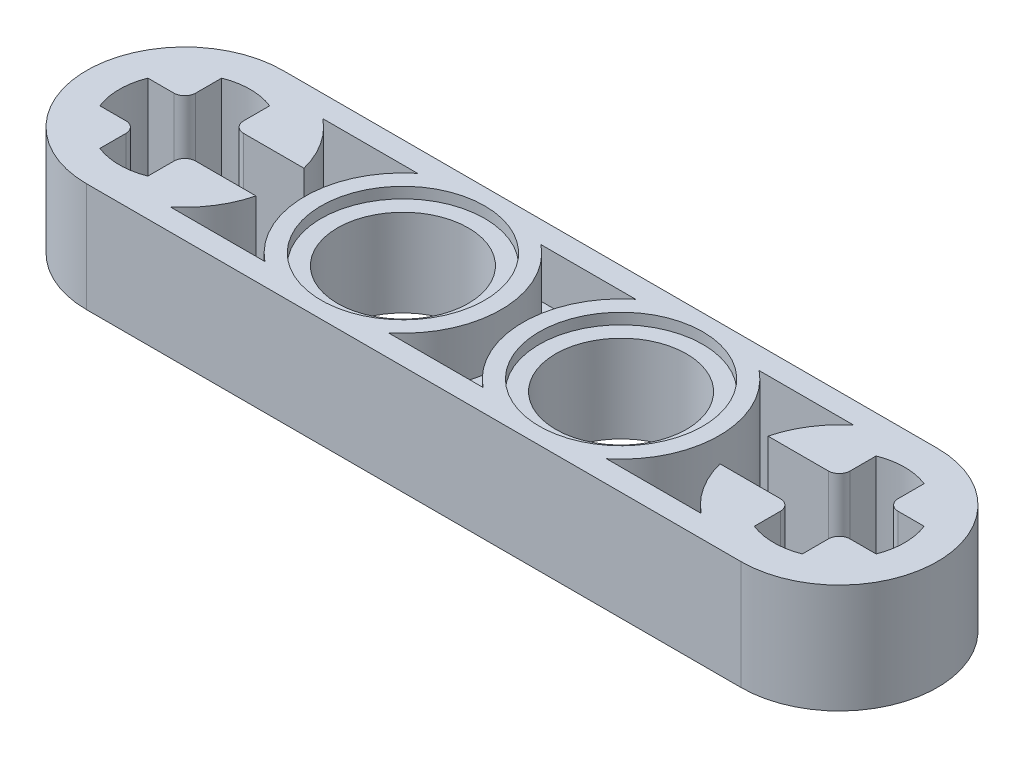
ISO-10303-21;
HEADER;
FILE_DESCRIPTION(('STEP AP214'),'2;1');
FILE_NAME('part.step','',(''),(''),'','','');
FILE_SCHEMA(('AUTOMOTIVE_DESIGN { 1 0 10303 214 1 1 1 1 }'));
ENDSEC;
DATA;
#1=APPLICATION_CONTEXT('core data for automotive mechanical design processes');
#2=APPLICATION_PROTOCOL_DEFINITION('international standard','automotive_design',2000,#1);
#3=PRODUCT_CONTEXT('',#1,'mechanical');
#4=PRODUCT('Part','Part','',(#3));
#5=PRODUCT_RELATED_PRODUCT_CATEGORY('part','',(#4));
#6=PRODUCT_DEFINITION_FORMATION('','',#4);
#7=PRODUCT_DEFINITION_CONTEXT('part definition',#1,'design');
#8=PRODUCT_DEFINITION('design','',#6,#7);
#9=PRODUCT_DEFINITION_SHAPE('','',#8);
#10=(LENGTH_UNIT() NAMED_UNIT(*) SI_UNIT(.MILLI.,.METRE.));
#11=(NAMED_UNIT(*) PLANE_ANGLE_UNIT() SI_UNIT($,.RADIAN.));
#12=(NAMED_UNIT(*) SI_UNIT($,.STERADIAN.) SOLID_ANGLE_UNIT());
#13=UNCERTAINTY_MEASURE_WITH_UNIT(LENGTH_MEASURE(1.E-05),#10,'distance_accuracy_value','');
#14=(GEOMETRIC_REPRESENTATION_CONTEXT(3) GLOBAL_UNCERTAINTY_ASSIGNED_CONTEXT((#13)) GLOBAL_UNIT_ASSIGNED_CONTEXT((#10,
#11,#12)) REPRESENTATION_CONTEXT('',''));
#15=CARTESIAN_POINT('',(0.,0.,0.));
#16=DIRECTION('',(0.,0.,1.));
#17=DIRECTION('',(1.,0.,0.));
#18=AXIS2_PLACEMENT_3D('',#15,#16,#17);
#19=CARTESIAN_POINT('',(-4.,4.,0.));
#20=DIRECTION('',(0.,-1.,0.));
#21=DIRECTION('',(0.,0.,-1.));
#22=AXIS2_PLACEMENT_3D('',#19,#20,#21);
#23=CYLINDRICAL_SURFACE('',#22,2.4);
#24=CARTESIAN_POINT('',(-4.,0.4,0.));
#25=DIRECTION('',(0.,-1.,0.));
#26=DIRECTION('',(0.,0.,-1.));
#27=AXIS2_PLACEMENT_3D('',#24,#25,#26);
#28=CIRCLE('',#27,2.4);
#29=CARTESIAN_POINT('',(-4.,0.4,-2.4));
#30=VERTEX_POINT('',#29);
#31=EDGE_CURVE('E411',#30,#30,#28,.T.);
#32=ORIENTED_EDGE('',*,*,#31,.T.);
#33=EDGE_LOOP('',(#32));
#34=FACE_BOUND('',#33,.T.);
#35=CARTESIAN_POINT('',(-4.,3.6,0.));
#36=DIRECTION('',(0.,1.,0.));
#37=DIRECTION('',(0.,0.,1.));
#38=AXIS2_PLACEMENT_3D('',#35,#36,#37);
#39=CIRCLE('',#38,2.4);
#40=CARTESIAN_POINT('',(-4.,3.6,2.4));
#41=VERTEX_POINT('',#40);
#42=EDGE_CURVE('E43',#41,#41,#39,.T.);
#43=ORIENTED_EDGE('',*,*,#42,.T.);
#44=EDGE_LOOP('',(#43));
#45=FACE_BOUND('',#44,.T.);
#46=ADVANCED_FACE('F39',(#34,#45),#23,.F.);
#47=CARTESIAN_POINT('',(4.,4.,0.));
#48=DIRECTION('',(0.,-1.,0.));
#49=DIRECTION('',(0.,0.,-1.));
#50=AXIS2_PLACEMENT_3D('',#47,#48,#49);
#51=CYLINDRICAL_SURFACE('',#50,2.4);
#52=CARTESIAN_POINT('',(4.,0.4,0.));
#53=DIRECTION('',(0.,-1.,0.));
#54=DIRECTION('',(0.,0.,-1.));
#55=AXIS2_PLACEMENT_3D('',#52,#53,#54);
#56=CIRCLE('',#55,2.4);
#57=CARTESIAN_POINT('',(4.,0.4,-2.4));
#58=VERTEX_POINT('',#57);
#59=EDGE_CURVE('E911',#58,#58,#56,.T.);
#60=ORIENTED_EDGE('',*,*,#59,.T.);
#61=EDGE_LOOP('',(#60));
#62=FACE_BOUND('',#61,.T.);
#63=CARTESIAN_POINT('',(4.,3.6,0.));
#64=DIRECTION('',(0.,1.,0.));
#65=DIRECTION('',(0.,0.,1.));
#66=AXIS2_PLACEMENT_3D('',#63,#64,#65);
#67=CIRCLE('',#66,2.4);
#68=CARTESIAN_POINT('',(4.,3.6,2.4));
#69=VERTEX_POINT('',#68);
#70=EDGE_CURVE('E918',#69,#69,#67,.T.);
#71=ORIENTED_EDGE('',*,*,#70,.T.);
#72=EDGE_LOOP('',(#71));
#73=FACE_BOUND('',#72,.T.);
#74=ADVANCED_FACE('F965',(#62,#73),#51,.F.);
#75=CARTESIAN_POINT('',(-12.,0.,0.));
#76=DIRECTION('',(0.,1.,0.));
#77=DIRECTION('',(0.,0.,1.));
#78=AXIS2_PLACEMENT_3D('',#75,#76,#77);
#79=PLANE('',#78);
#80=CARTESIAN_POINT('',(-4.,0.,0.));
#81=DIRECTION('',(0.,-1.,0.));
#82=DIRECTION('',(0.,0.,-1.));
#83=AXIS2_PLACEMENT_3D('',#80,#81,#82);
#84=CIRCLE('',#83,3.);
#85=CARTESIAN_POINT('',(-4.,0.,-3.));
#86=VERTEX_POINT('',#85);
#87=EDGE_CURVE('E947',#86,#86,#84,.T.);
#88=ORIENTED_EDGE('',*,*,#87,.F.);
#89=EDGE_LOOP('',(#88));
#90=FACE_BOUND('',#89,.T.);
#91=CARTESIAN_POINT('',(4.,0.,0.));
#92=DIRECTION('',(0.,-1.,0.));
#93=DIRECTION('',(0.,0.,-1.));
#94=AXIS2_PLACEMENT_3D('',#91,#92,#93);
#95=CIRCLE('',#94,3.);
#96=CARTESIAN_POINT('',(4.,0.,-3.));
#97=VERTEX_POINT('',#96);
#98=EDGE_CURVE('E401',#97,#97,#95,.T.);
#99=ORIENTED_EDGE('',*,*,#98,.F.);
#100=EDGE_LOOP('',(#99));
#101=FACE_BOUND('',#100,.T.);
#102=DIRECTION('',(1.,0.,0.));
#103=VECTOR('',#102,1.);
#104=CARTESIAN_POINT('',(9.76715428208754,0.,0.880000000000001));
#105=LINE('',#104,#103);
#106=CARTESIAN_POINT('',(8.50921212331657,0.,0.880000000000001));
#107=VERTEX_POINT('',#106);
#108=CARTESIAN_POINT('',(10.72,0.,0.880000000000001));
#109=VERTEX_POINT('',#108);
#110=EDGE_CURVE('E459',#107,#109,#105,.T.);
#111=ORIENTED_EDGE('',*,*,#110,.T.);
#112=CARTESIAN_POINT('',(10.72,0.,1.28));
#113=DIRECTION('',(0.,-1.,0.));
#114=DIRECTION('',(0.,0.,-1.));
#115=AXIS2_PLACEMENT_3D('',#112,#113,#114);
#116=CIRCLE('',#115,0.4);
#117=CARTESIAN_POINT('',(11.12,0.,1.28));
#118=VERTEX_POINT('',#117);
#119=EDGE_CURVE('E534',#109,#118,#116,.T.);
#120=ORIENTED_EDGE('',*,*,#119,.T.);
#121=DIRECTION('',(0.,0.,1.));
#122=VECTOR('',#121,1.);
#123=CARTESIAN_POINT('',(11.12,0.,1.28));
#124=LINE('',#123,#122);
#125=CARTESIAN_POINT('',(11.12,0.,2.23284571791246));
#126=VERTEX_POINT('',#125);
#127=EDGE_CURVE('E538',#118,#126,#124,.T.);
#128=ORIENTED_EDGE('',*,*,#127,.T.);
#129=CARTESIAN_POINT('',(12.,0.,0.));
#130=DIRECTION('',(0.,1.,0.));
#131=DIRECTION('',(0.,0.,1.));
#132=AXIS2_PLACEMENT_3D('',#129,#130,#131);
#133=CIRCLE('',#132,2.4);
#134=CARTESIAN_POINT('',(12.88,0.,2.23284571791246));
#135=VERTEX_POINT('',#134);
#136=EDGE_CURVE('E542',#126,#135,#133,.T.);
#137=ORIENTED_EDGE('',*,*,#136,.T.);
#138=DIRECTION('',(0.,0.,-1.));
#139=VECTOR('',#138,1.);
#140=CARTESIAN_POINT('',(12.88,0.,2.23284571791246));
#141=LINE('',#140,#139);
#142=CARTESIAN_POINT('',(12.88,0.,1.28));
#143=VERTEX_POINT('',#142);
#144=EDGE_CURVE('E546',#135,#143,#141,.T.);
#145=ORIENTED_EDGE('',*,*,#144,.T.);
#146=CARTESIAN_POINT('',(13.28,0.,1.28));
#147=DIRECTION('',(0.,-1.,0.));
#148=DIRECTION('',(0.,0.,1.));
#149=AXIS2_PLACEMENT_3D('',#146,#147,#148);
#150=CIRCLE('',#149,0.4);
#151=CARTESIAN_POINT('',(13.28,0.,0.880000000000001));
#152=VERTEX_POINT('',#151);
#153=EDGE_CURVE('E550',#143,#152,#150,.T.);
#154=ORIENTED_EDGE('',*,*,#153,.T.);
#155=DIRECTION('',(1.,0.,0.));
#156=VECTOR('',#155,1.);
#157=CARTESIAN_POINT('',(13.28,0.,0.88));
#158=LINE('',#157,#156);
#159=CARTESIAN_POINT('',(14.2328457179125,0.,0.88));
#160=VERTEX_POINT('',#159);
#161=EDGE_CURVE('E554',#152,#160,#158,.T.);
#162=ORIENTED_EDGE('',*,*,#161,.T.);
#163=CARTESIAN_POINT('',(12.,0.,0.));
#164=DIRECTION('',(0.,1.,0.));
#165=DIRECTION('',(0.,0.,1.));
#166=AXIS2_PLACEMENT_3D('',#163,#164,#165);
#167=CIRCLE('',#166,2.4);
#168=CARTESIAN_POINT('',(14.2328457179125,0.,-0.88));
#169=VERTEX_POINT('',#168);
#170=EDGE_CURVE('E558',#160,#169,#167,.T.);
#171=ORIENTED_EDGE('',*,*,#170,.T.);
#172=DIRECTION('',(-1.,0.,0.));
#173=VECTOR('',#172,1.);
#174=CARTESIAN_POINT('',(14.2328457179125,0.,-0.88));
#175=LINE('',#174,#173);
#176=CARTESIAN_POINT('',(13.28,0.,-0.88));
#177=VERTEX_POINT('',#176);
#178=EDGE_CURVE('E562',#169,#177,#175,.T.);
#179=ORIENTED_EDGE('',*,*,#178,.T.);
#180=CARTESIAN_POINT('',(13.28,0.,-1.28));
#181=DIRECTION('',(0.,-1.,0.));
#182=DIRECTION('',(0.,0.,-1.));
#183=AXIS2_PLACEMENT_3D('',#180,#181,#182);
#184=CIRCLE('',#183,0.4);
#185=CARTESIAN_POINT('',(12.88,0.,-1.28));
#186=VERTEX_POINT('',#185);
#187=EDGE_CURVE('E566',#177,#186,#184,.T.);
#188=ORIENTED_EDGE('',*,*,#187,.T.);
#189=DIRECTION('',(0.,0.,-1.));
#190=VECTOR('',#189,1.);
#191=CARTESIAN_POINT('',(12.88,0.,-1.28));
#192=LINE('',#191,#190);
#193=CARTESIAN_POINT('',(12.88,0.,-2.23284571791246));
#194=VERTEX_POINT('',#193);
#195=EDGE_CURVE('E570',#186,#194,#192,.T.);
#196=ORIENTED_EDGE('',*,*,#195,.T.);
#197=CARTESIAN_POINT('',(12.,0.,0.));
#198=DIRECTION('',(0.,1.,0.));
#199=DIRECTION('',(0.,0.,1.));
#200=AXIS2_PLACEMENT_3D('',#197,#198,#199);
#201=CIRCLE('',#200,2.4);
#202=CARTESIAN_POINT('',(11.12,0.,-2.23284571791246));
#203=VERTEX_POINT('',#202);
#204=EDGE_CURVE('E574',#194,#203,#201,.T.);
#205=ORIENTED_EDGE('',*,*,#204,.T.);
#206=DIRECTION('',(0.,0.,1.));
#207=VECTOR('',#206,1.);
#208=CARTESIAN_POINT('',(11.12,0.,-2.23284571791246));
#209=LINE('',#208,#207);
#210=CARTESIAN_POINT('',(11.12,0.,-1.28));
#211=VERTEX_POINT('',#210);
#212=EDGE_CURVE('E578',#203,#211,#209,.T.);
#213=ORIENTED_EDGE('',*,*,#212,.T.);
#214=CARTESIAN_POINT('',(10.72,0.,-1.28));
#215=DIRECTION('',(0.,-1.,0.));
#216=DIRECTION('',(0.,0.,1.));
#217=AXIS2_PLACEMENT_3D('',#214,#215,#216);
#218=CIRCLE('',#217,0.4);
#219=CARTESIAN_POINT('',(10.72,0.,-0.88));
#220=VERTEX_POINT('',#219);
#221=EDGE_CURVE('E582',#211,#220,#218,.T.);
#222=ORIENTED_EDGE('',*,*,#221,.T.);
#223=DIRECTION('',(-1.,0.,0.));
#224=VECTOR('',#223,1.);
#225=CARTESIAN_POINT('',(9.76715428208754,0.,-0.879999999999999));
#226=LINE('',#225,#224);
#227=CARTESIAN_POINT('',(8.50921212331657,0.,-0.879999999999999));
#228=VERTEX_POINT('',#227);
#229=EDGE_CURVE('E586',#220,#228,#226,.T.);
#230=ORIENTED_EDGE('',*,*,#229,.T.);
#231=CARTESIAN_POINT('',(12.,0.,0.));
#232=DIRECTION('',(0.,-1.,0.));
#233=DIRECTION('',(0.,0.,1.));
#234=AXIS2_PLACEMENT_3D('',#231,#232,#233);
#235=CIRCLE('',#234,3.6);
#236=CARTESIAN_POINT('',(9.73725830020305,0.,-2.8));
#237=VERTEX_POINT('',#236);
#238=EDGE_CURVE('E590',#228,#237,#235,.T.);
#239=ORIENTED_EDGE('',*,*,#238,.T.);
#240=DIRECTION('',(-1.,0.,0.));
#241=VECTOR('',#240,1.);
#242=CARTESIAN_POINT('',(6.26274169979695,0.,-2.8));
#243=LINE('',#242,#241);
#244=CARTESIAN_POINT('',(6.26274169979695,0.,-2.8));
#245=VERTEX_POINT('',#244);
#246=EDGE_CURVE('E594',#237,#245,#243,.T.);
#247=ORIENTED_EDGE('',*,*,#246,.T.);
#248=CARTESIAN_POINT('',(4.,0.,0.));
#249=DIRECTION('',(0.,-1.,0.));
#250=DIRECTION('',(0.,0.,1.));
#251=AXIS2_PLACEMENT_3D('',#248,#249,#250);
#252=CIRCLE('',#251,3.6);
#253=CARTESIAN_POINT('',(6.26274169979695,0.,2.8));
#254=VERTEX_POINT('',#253);
#255=EDGE_CURVE('E598',#245,#254,#252,.T.);
#256=ORIENTED_EDGE('',*,*,#255,.T.);
#257=DIRECTION('',(1.,0.,0.));
#258=VECTOR('',#257,1.);
#259=CARTESIAN_POINT('',(6.26274169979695,0.,2.8));
#260=LINE('',#259,#258);
#261=CARTESIAN_POINT('',(9.73725830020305,0.,2.8));
#262=VERTEX_POINT('',#261);
#263=EDGE_CURVE('E602',#254,#262,#260,.T.);
#264=ORIENTED_EDGE('',*,*,#263,.T.);
#265=CARTESIAN_POINT('',(12.,0.,0.));
#266=DIRECTION('',(0.,-1.,0.));
#267=DIRECTION('',(0.,0.,1.));
#268=AXIS2_PLACEMENT_3D('',#265,#266,#267);
#269=CIRCLE('',#268,3.6);
#270=EDGE_CURVE('E472',#262,#107,#269,.T.);
#271=ORIENTED_EDGE('',*,*,#270,.T.);
#272=EDGE_LOOP('',(#111,#120,#128,#137,#145,#154,#162,#171,#179,#188,#196,#205,#213,#222,#230,
#239,#247,#256,#264,#271));
#273=FACE_BOUND('',#272,.T.);
#274=CARTESIAN_POINT('',(-12.,0.,0.));
#275=DIRECTION('',(0.,1.,0.));
#276=DIRECTION('',(0.,0.,1.));
#277=AXIS2_PLACEMENT_3D('',#274,#275,#276);
#278=CIRCLE('',#277,3.6);
#279=CARTESIAN_POINT('',(-12.,0.,-3.6));
#280=VERTEX_POINT('',#279);
#281=CARTESIAN_POINT('',(-12.,0.,3.6));
#282=VERTEX_POINT('',#281);
#283=EDGE_CURVE('E874',#280,#282,#278,.T.);
#284=ORIENTED_EDGE('',*,*,#283,.F.);
#285=DIRECTION('',(-1.,0.,0.));
#286=VECTOR('',#285,1.);
#287=CARTESIAN_POINT('',(-12.,0.,-3.6));
#288=LINE('',#287,#286);
#289=CARTESIAN_POINT('',(12.,0.,-3.6));
#290=VERTEX_POINT('',#289);
#291=EDGE_CURVE('E880',#290,#280,#288,.T.);
#292=ORIENTED_EDGE('',*,*,#291,.F.);
#293=CARTESIAN_POINT('',(12.,0.,0.));
#294=DIRECTION('',(0.,1.,0.));
#295=DIRECTION('',(0.,0.,1.));
#296=AXIS2_PLACEMENT_3D('',#293,#294,#295);
#297=CIRCLE('',#296,3.6);
#298=CARTESIAN_POINT('',(12.,0.,3.6));
#299=VERTEX_POINT('',#298);
#300=EDGE_CURVE('E896',#299,#290,#297,.T.);
#301=ORIENTED_EDGE('',*,*,#300,.F.);
#302=DIRECTION('',(1.,0.,0.));
#303=VECTOR('',#302,1.);
#304=CARTESIAN_POINT('',(12.,0.,3.6));
#305=LINE('',#304,#303);
#306=EDGE_CURVE('E893',#282,#299,#305,.T.);
#307=ORIENTED_EDGE('',*,*,#306,.F.);
#308=EDGE_LOOP('',(#284,#292,#301,#307));
#309=FACE_BOUND('',#308,.T.);
#310=CARTESIAN_POINT('',(-12.,0.,0.));
#311=DIRECTION('',(0.,1.,0.));
#312=DIRECTION('',(0.,0.,1.));
#313=AXIS2_PLACEMENT_3D('',#310,#311,#312);
#314=CIRCLE('',#313,2.4);
#315=CARTESIAN_POINT('',(-12.88,0.,2.23284571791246));
#316=VERTEX_POINT('',#315);
#317=CARTESIAN_POINT('',(-11.12,0.,2.23284571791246));
#318=VERTEX_POINT('',#317);
#319=EDGE_CURVE('E669',#316,#318,#314,.T.);
#320=ORIENTED_EDGE('',*,*,#319,.T.);
#321=DIRECTION('',(0.,0.,-1.));
#322=VECTOR('',#321,1.);
#323=CARTESIAN_POINT('',(-11.12,0.,1.28));
#324=LINE('',#323,#322);
#325=CARTESIAN_POINT('',(-11.12,0.,1.28));
#326=VERTEX_POINT('',#325);
#327=EDGE_CURVE('E736',#318,#326,#324,.T.);
#328=ORIENTED_EDGE('',*,*,#327,.T.);
#329=CARTESIAN_POINT('',(-10.72,0.,1.28));
#330=DIRECTION('',(0.,-1.,0.));
#331=DIRECTION('',(0.,0.,1.));
#332=AXIS2_PLACEMENT_3D('',#329,#330,#331);
#333=CIRCLE('',#332,0.4);
#334=CARTESIAN_POINT('',(-10.72,0.,0.88));
#335=VERTEX_POINT('',#334);
#336=EDGE_CURVE('E740',#326,#335,#333,.T.);
#337=ORIENTED_EDGE('',*,*,#336,.T.);
#338=DIRECTION('',(1.,0.,0.));
#339=VECTOR('',#338,1.);
#340=CARTESIAN_POINT('',(-9.76715428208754,0.,0.88));
#341=LINE('',#340,#339);
#342=CARTESIAN_POINT('',(-8.50921212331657,0.,0.88));
#343=VERTEX_POINT('',#342);
#344=EDGE_CURVE('E744',#335,#343,#341,.T.);
#345=ORIENTED_EDGE('',*,*,#344,.T.);
#346=CARTESIAN_POINT('',(-12.,0.,0.));
#347=DIRECTION('',(0.,-1.,0.));
#348=DIRECTION('',(0.,0.,1.));
#349=AXIS2_PLACEMENT_3D('',#346,#347,#348);
#350=CIRCLE('',#349,3.6);
#351=CARTESIAN_POINT('',(-9.73725830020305,0.,2.8));
#352=VERTEX_POINT('',#351);
#353=EDGE_CURVE('E748',#343,#352,#350,.T.);
#354=ORIENTED_EDGE('',*,*,#353,.T.);
#355=DIRECTION('',(1.,0.,0.));
#356=VECTOR('',#355,1.);
#357=CARTESIAN_POINT('',(-9.73725830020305,0.,2.8));
#358=LINE('',#357,#356);
#359=CARTESIAN_POINT('',(-6.26274169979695,0.,2.8));
#360=VERTEX_POINT('',#359);
#361=EDGE_CURVE('E752',#352,#360,#358,.T.);
#362=ORIENTED_EDGE('',*,*,#361,.T.);
#363=CARTESIAN_POINT('',(-4.,0.,0.));
#364=DIRECTION('',(0.,-1.,0.));
#365=DIRECTION('',(0.,0.,1.));
#366=AXIS2_PLACEMENT_3D('',#363,#364,#365);
#367=CIRCLE('',#366,3.6);
#368=CARTESIAN_POINT('',(-6.26274169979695,0.,-2.8));
#369=VERTEX_POINT('',#368);
#370=EDGE_CURVE('E756',#360,#369,#367,.T.);
#371=ORIENTED_EDGE('',*,*,#370,.T.);
#372=DIRECTION('',(-1.,0.,0.));
#373=VECTOR('',#372,1.);
#374=CARTESIAN_POINT('',(-9.73725830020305,0.,-2.8));
#375=LINE('',#374,#373);
#376=CARTESIAN_POINT('',(-9.73725830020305,0.,-2.8));
#377=VERTEX_POINT('',#376);
#378=EDGE_CURVE('E760',#369,#377,#375,.T.);
#379=ORIENTED_EDGE('',*,*,#378,.T.);
#380=CARTESIAN_POINT('',(-12.,0.,0.));
#381=DIRECTION('',(0.,-1.,0.));
#382=DIRECTION('',(0.,0.,1.));
#383=AXIS2_PLACEMENT_3D('',#380,#381,#382);
#384=CIRCLE('',#383,3.6);
#385=CARTESIAN_POINT('',(-8.50921212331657,0.,-0.879999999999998));
#386=VERTEX_POINT('',#385);
#387=EDGE_CURVE('E764',#377,#386,#384,.T.);
#388=ORIENTED_EDGE('',*,*,#387,.T.);
#389=DIRECTION('',(-1.,0.,0.));
#390=VECTOR('',#389,1.);
#391=CARTESIAN_POINT('',(-10.72,0.,-0.879999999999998));
#392=LINE('',#391,#390);
#393=CARTESIAN_POINT('',(-10.72,0.,-0.879999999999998));
#394=VERTEX_POINT('',#393);
#395=EDGE_CURVE('E768',#386,#394,#392,.T.);
#396=ORIENTED_EDGE('',*,*,#395,.T.);
#397=CARTESIAN_POINT('',(-10.72,0.,-1.28));
#398=DIRECTION('',(0.,-1.,0.));
#399=DIRECTION('',(0.,0.,-1.));
#400=AXIS2_PLACEMENT_3D('',#397,#398,#399);
#401=CIRCLE('',#400,0.4);
#402=CARTESIAN_POINT('',(-11.12,0.,-1.28));
#403=VERTEX_POINT('',#402);
#404=EDGE_CURVE('E772',#394,#403,#401,.T.);
#405=ORIENTED_EDGE('',*,*,#404,.T.);
#406=DIRECTION('',(0.,0.,-1.));
#407=VECTOR('',#406,1.);
#408=CARTESIAN_POINT('',(-11.12,0.,-2.23284571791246));
#409=LINE('',#408,#407);
#410=CARTESIAN_POINT('',(-11.12,0.,-2.23284571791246));
#411=VERTEX_POINT('',#410);
#412=EDGE_CURVE('E776',#403,#411,#409,.T.);
#413=ORIENTED_EDGE('',*,*,#412,.T.);
#414=CARTESIAN_POINT('',(-12.,0.,0.));
#415=DIRECTION('',(0.,1.,0.));
#416=DIRECTION('',(0.,0.,1.));
#417=AXIS2_PLACEMENT_3D('',#414,#415,#416);
#418=CIRCLE('',#417,2.4);
#419=CARTESIAN_POINT('',(-12.88,0.,-2.23284571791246));
#420=VERTEX_POINT('',#419);
#421=EDGE_CURVE('E780',#411,#420,#418,.T.);
#422=ORIENTED_EDGE('',*,*,#421,.T.);
#423=DIRECTION('',(0.,0.,1.));
#424=VECTOR('',#423,1.);
#425=CARTESIAN_POINT('',(-12.88,0.,-1.28));
#426=LINE('',#425,#424);
#427=CARTESIAN_POINT('',(-12.88,0.,-1.28));
#428=VERTEX_POINT('',#427);
#429=EDGE_CURVE('E784',#420,#428,#426,.T.);
#430=ORIENTED_EDGE('',*,*,#429,.T.);
#431=CARTESIAN_POINT('',(-13.28,0.,-1.28));
#432=DIRECTION('',(0.,-1.,0.));
#433=DIRECTION('',(0.,0.,1.));
#434=AXIS2_PLACEMENT_3D('',#431,#432,#433);
#435=CIRCLE('',#434,0.4);
#436=CARTESIAN_POINT('',(-13.28,0.,-0.879999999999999));
#437=VERTEX_POINT('',#436);
#438=EDGE_CURVE('E788',#428,#437,#435,.T.);
#439=ORIENTED_EDGE('',*,*,#438,.T.);
#440=DIRECTION('',(-1.,0.,0.));
#441=VECTOR('',#440,1.);
#442=CARTESIAN_POINT('',(-14.2328457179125,0.,-0.88));
#443=LINE('',#442,#441);
#444=CARTESIAN_POINT('',(-14.2328457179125,0.,-0.88));
#445=VERTEX_POINT('',#444);
#446=EDGE_CURVE('E792',#437,#445,#443,.T.);
#447=ORIENTED_EDGE('',*,*,#446,.T.);
#448=CARTESIAN_POINT('',(-12.,0.,0.));
#449=DIRECTION('',(0.,1.,0.));
#450=DIRECTION('',(0.,0.,1.));
#451=AXIS2_PLACEMENT_3D('',#448,#449,#450);
#452=CIRCLE('',#451,2.4);
#453=CARTESIAN_POINT('',(-14.2328457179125,0.,0.879999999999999));
#454=VERTEX_POINT('',#453);
#455=EDGE_CURVE('E796',#445,#454,#452,.T.);
#456=ORIENTED_EDGE('',*,*,#455,.T.);
#457=DIRECTION('',(1.,0.,0.));
#458=VECTOR('',#457,1.);
#459=CARTESIAN_POINT('',(-14.2328457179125,0.,0.88));
#460=LINE('',#459,#458);
#461=CARTESIAN_POINT('',(-13.28,0.,0.88));
#462=VERTEX_POINT('',#461);
#463=EDGE_CURVE('E800',#454,#462,#460,.T.);
#464=ORIENTED_EDGE('',*,*,#463,.T.);
#465=CARTESIAN_POINT('',(-13.28,0.,1.28));
#466=DIRECTION('',(0.,-1.,0.));
#467=DIRECTION('',(0.,0.,1.));
#468=AXIS2_PLACEMENT_3D('',#465,#466,#467);
#469=CIRCLE('',#468,0.4);
#470=CARTESIAN_POINT('',(-12.88,0.,1.28));
#471=VERTEX_POINT('',#470);
#472=EDGE_CURVE('E804',#462,#471,#469,.T.);
#473=ORIENTED_EDGE('',*,*,#472,.T.);
#474=DIRECTION('',(0.,0.,1.));
#475=VECTOR('',#474,1.);
#476=CARTESIAN_POINT('',(-12.88,0.,2.23284571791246));
#477=LINE('',#476,#475);
#478=EDGE_CURVE('E674',#471,#316,#477,.T.);
#479=ORIENTED_EDGE('',*,*,#478,.T.);
#480=EDGE_LOOP('',(#320,#328,#337,#345,#354,#362,#371,#379,#388,#396,#405,#413,#422,#430,#439,
#447,#456,#464,#473,#479));
#481=FACE_BOUND('',#480,.T.);
#482=CARTESIAN_POINT('',(4.,0.,0.));
#483=DIRECTION('',(0.,-1.,0.));
#484=DIRECTION('',(0.,0.,1.));
#485=AXIS2_PLACEMENT_3D('',#482,#483,#484);
#486=CIRCLE('',#485,3.6);
#487=CARTESIAN_POINT('',(1.73725830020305,0.,2.8));
#488=VERTEX_POINT('',#487);
#489=CARTESIAN_POINT('',(1.73725830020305,0.,-2.8));
#490=VERTEX_POINT('',#489);
#491=EDGE_CURVE('E57',#488,#490,#486,.T.);
#492=ORIENTED_EDGE('',*,*,#491,.T.);
#493=DIRECTION('',(-1.,0.,0.));
#494=VECTOR('',#493,1.);
#495=CARTESIAN_POINT('',(-1.73725830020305,0.,-2.8));
#496=LINE('',#495,#494);
#497=CARTESIAN_POINT('',(-1.73725830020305,0.,-2.8));
#498=VERTEX_POINT('',#497);
#499=EDGE_CURVE('E394',#490,#498,#496,.T.);
#500=ORIENTED_EDGE('',*,*,#499,.T.);
#501=CARTESIAN_POINT('',(-4.,0.,0.));
#502=DIRECTION('',(0.,-1.,0.));
#503=DIRECTION('',(0.,0.,1.));
#504=AXIS2_PLACEMENT_3D('',#501,#502,#503);
#505=CIRCLE('',#504,3.6);
#506=CARTESIAN_POINT('',(-1.73725830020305,0.,2.8));
#507=VERTEX_POINT('',#506);
#508=EDGE_CURVE('E398',#498,#507,#505,.T.);
#509=ORIENTED_EDGE('',*,*,#508,.T.);
#510=DIRECTION('',(1.,0.,0.));
#511=VECTOR('',#510,1.);
#512=CARTESIAN_POINT('',(-1.73725830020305,0.,2.8));
#513=LINE('',#512,#511);
#514=EDGE_CURVE('E410',#507,#488,#513,.T.);
#515=ORIENTED_EDGE('',*,*,#514,.T.);
#516=EDGE_LOOP('',(#492,#500,#509,#515));
#517=FACE_BOUND('',#516,.T.);
#518=ADVANCED_FACE('F961',(#90,#101,#273,#309,#481,#517),#79,.F.);
#519=CARTESIAN_POINT('',(-12.,4.,0.));
#520=DIRECTION('',(0.,1.,0.));
#521=DIRECTION('',(0.,0.,1.));
#522=AXIS2_PLACEMENT_3D('',#519,#520,#521);
#523=PLANE('',#522);
#524=CARTESIAN_POINT('',(-4.,4.,0.));
#525=DIRECTION('',(0.,-1.,0.));
#526=DIRECTION('',(0.,0.,-1.));
#527=AXIS2_PLACEMENT_3D('',#524,#525,#526);
#528=CIRCLE('',#527,3.);
#529=CARTESIAN_POINT('',(-4.,4.,-3.));
#530=VERTEX_POINT('',#529);
#531=EDGE_CURVE('E928',#530,#530,#528,.T.);
#532=ORIENTED_EDGE('',*,*,#531,.T.);
#533=EDGE_LOOP('',(#532));
#534=FACE_BOUND('',#533,.T.);
#535=CARTESIAN_POINT('',(4.,4.,0.));
#536=DIRECTION('',(0.,-1.,0.));
#537=DIRECTION('',(0.,0.,-1.));
#538=AXIS2_PLACEMENT_3D('',#535,#536,#537);
#539=CIRCLE('',#538,3.);
#540=CARTESIAN_POINT('',(4.,4.,-3.));
#541=VERTEX_POINT('',#540);
#542=EDGE_CURVE('E940',#541,#541,#539,.T.);
#543=ORIENTED_EDGE('',*,*,#542,.T.);
#544=EDGE_LOOP('',(#543));
#545=FACE_BOUND('',#544,.T.);
#546=CARTESIAN_POINT('',(4.,4.,0.));
#547=DIRECTION('',(0.,-1.,0.));
#548=DIRECTION('',(0.,0.,1.));
#549=AXIS2_PLACEMENT_3D('',#546,#547,#548);
#550=CIRCLE('',#549,3.6);
#551=CARTESIAN_POINT('',(1.73725830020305,4.,2.8));
#552=VERTEX_POINT('',#551);
#553=CARTESIAN_POINT('',(1.73725830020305,4.,-2.8));
#554=VERTEX_POINT('',#553);
#555=EDGE_CURVE('E65',#552,#554,#550,.T.);
#556=ORIENTED_EDGE('',*,*,#555,.F.);
#557=DIRECTION('',(1.,0.,0.));
#558=VECTOR('',#557,1.);
#559=CARTESIAN_POINT('',(-1.73725830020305,4.,2.8));
#560=LINE('',#559,#558);
#561=CARTESIAN_POINT('',(-1.73725830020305,4.,2.8));
#562=VERTEX_POINT('',#561);
#563=EDGE_CURVE('E430',#562,#552,#560,.T.);
#564=ORIENTED_EDGE('',*,*,#563,.F.);
#565=CARTESIAN_POINT('',(-4.,4.,0.));
#566=DIRECTION('',(0.,-1.,0.));
#567=DIRECTION('',(0.,0.,1.));
#568=AXIS2_PLACEMENT_3D('',#565,#566,#567);
#569=CIRCLE('',#568,3.6);
#570=CARTESIAN_POINT('',(-1.73725830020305,4.,-2.8));
#571=VERTEX_POINT('',#570);
#572=EDGE_CURVE('E449',#571,#562,#569,.T.);
#573=ORIENTED_EDGE('',*,*,#572,.F.);
#574=DIRECTION('',(-1.,0.,0.));
#575=VECTOR('',#574,1.);
#576=CARTESIAN_POINT('',(-1.73725830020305,4.,-2.8));
#577=LINE('',#576,#575);
#578=EDGE_CURVE('E445',#554,#571,#577,.T.);
#579=ORIENTED_EDGE('',*,*,#578,.F.);
#580=EDGE_LOOP('',(#556,#564,#573,#579));
#581=FACE_BOUND('',#580,.T.);
#582=DIRECTION('',(0.,0.,-1.));
#583=VECTOR('',#582,1.);
#584=CARTESIAN_POINT('',(-11.12,4.,1.28));
#585=LINE('',#584,#583);
#586=CARTESIAN_POINT('',(-11.12,4.,2.23284571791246));
#587=VERTEX_POINT('',#586);
#588=CARTESIAN_POINT('',(-11.12,4.,1.28));
#589=VERTEX_POINT('',#588);
#590=EDGE_CURVE('E673',#587,#589,#585,.T.);
#591=ORIENTED_EDGE('',*,*,#590,.F.);
#592=CARTESIAN_POINT('',(-12.,4.,0.));
#593=DIRECTION('',(0.,1.,0.));
#594=DIRECTION('',(0.,0.,1.));
#595=AXIS2_PLACEMENT_3D('',#592,#593,#594);
#596=CIRCLE('',#595,2.4);
#597=CARTESIAN_POINT('',(-12.88,4.,2.23284571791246));
#598=VERTEX_POINT('',#597);
#599=EDGE_CURVE('E670',#598,#587,#596,.T.);
#600=ORIENTED_EDGE('',*,*,#599,.F.);
#601=DIRECTION('',(0.,0.,1.));
#602=VECTOR('',#601,1.);
#603=CARTESIAN_POINT('',(-12.88,4.,2.23284571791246));
#604=LINE('',#603,#602);
#605=CARTESIAN_POINT('',(-12.88,4.,1.28));
#606=VERTEX_POINT('',#605);
#607=EDGE_CURVE('E729',#606,#598,#604,.T.);
#608=ORIENTED_EDGE('',*,*,#607,.F.);
#609=CARTESIAN_POINT('',(-13.28,4.,1.28));
#610=DIRECTION('',(0.,-1.,0.));
#611=DIRECTION('',(0.,0.,1.));
#612=AXIS2_PLACEMENT_3D('',#609,#610,#611);
#613=CIRCLE('',#612,0.4);
#614=CARTESIAN_POINT('',(-13.28,4.,0.88));
#615=VERTEX_POINT('',#614);
#616=EDGE_CURVE('E725',#615,#606,#613,.T.);
#617=ORIENTED_EDGE('',*,*,#616,.F.);
#618=DIRECTION('',(1.,0.,0.));
#619=VECTOR('',#618,1.);
#620=CARTESIAN_POINT('',(-14.2328457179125,4.,0.88));
#621=LINE('',#620,#619);
#622=CARTESIAN_POINT('',(-14.2328457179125,4.,0.879999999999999));
#623=VERTEX_POINT('',#622);
#624=EDGE_CURVE('E722',#623,#615,#621,.T.);
#625=ORIENTED_EDGE('',*,*,#624,.F.);
#626=CARTESIAN_POINT('',(-12.,4.,0.));
#627=DIRECTION('',(0.,1.,0.));
#628=DIRECTION('',(0.,0.,1.));
#629=AXIS2_PLACEMENT_3D('',#626,#627,#628);
#630=CIRCLE('',#629,2.4);
#631=CARTESIAN_POINT('',(-14.2328457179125,4.,-0.88));
#632=VERTEX_POINT('',#631);
#633=EDGE_CURVE('E719',#632,#623,#630,.T.);
#634=ORIENTED_EDGE('',*,*,#633,.F.);
#635=DIRECTION('',(-1.,0.,0.));
#636=VECTOR('',#635,1.);
#637=CARTESIAN_POINT('',(-14.2328457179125,4.,-0.88));
#638=LINE('',#637,#636);
#639=CARTESIAN_POINT('',(-13.28,4.,-0.879999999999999));
#640=VERTEX_POINT('',#639);
#641=EDGE_CURVE('E716',#640,#632,#638,.T.);
#642=ORIENTED_EDGE('',*,*,#641,.F.);
#643=CARTESIAN_POINT('',(-13.28,4.,-1.28));
#644=DIRECTION('',(0.,-1.,0.));
#645=DIRECTION('',(0.,0.,1.));
#646=AXIS2_PLACEMENT_3D('',#643,#644,#645);
#647=CIRCLE('',#646,0.4);
#648=CARTESIAN_POINT('',(-12.88,4.,-1.28));
#649=VERTEX_POINT('',#648);
#650=EDGE_CURVE('E713',#649,#640,#647,.T.);
#651=ORIENTED_EDGE('',*,*,#650,.F.);
#652=DIRECTION('',(0.,0.,1.));
#653=VECTOR('',#652,1.);
#654=CARTESIAN_POINT('',(-12.88,4.,-1.28));
#655=LINE('',#654,#653);
#656=CARTESIAN_POINT('',(-12.88,4.,-2.23284571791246));
#657=VERTEX_POINT('',#656);
#658=EDGE_CURVE('E710',#657,#649,#655,.T.);
#659=ORIENTED_EDGE('',*,*,#658,.F.);
#660=CARTESIAN_POINT('',(-12.,4.,0.));
#661=DIRECTION('',(0.,1.,0.));
#662=DIRECTION('',(0.,0.,1.));
#663=AXIS2_PLACEMENT_3D('',#660,#661,#662);
#664=CIRCLE('',#663,2.4);
#665=CARTESIAN_POINT('',(-11.12,4.,-2.23284571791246));
#666=VERTEX_POINT('',#665);
#667=EDGE_CURVE('E707',#666,#657,#664,.T.);
#668=ORIENTED_EDGE('',*,*,#667,.F.);
#669=DIRECTION('',(0.,0.,-1.));
#670=VECTOR('',#669,1.);
#671=CARTESIAN_POINT('',(-11.12,4.,-2.23284571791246));
#672=LINE('',#671,#670);
#673=CARTESIAN_POINT('',(-11.12,4.,-1.28));
#674=VERTEX_POINT('',#673);
#675=EDGE_CURVE('E704',#674,#666,#672,.T.);
#676=ORIENTED_EDGE('',*,*,#675,.F.);
#677=CARTESIAN_POINT('',(-10.72,4.,-1.28));
#678=DIRECTION('',(0.,-1.,0.));
#679=DIRECTION('',(0.,0.,-1.));
#680=AXIS2_PLACEMENT_3D('',#677,#678,#679);
#681=CIRCLE('',#680,0.4);
#682=CARTESIAN_POINT('',(-10.72,4.,-0.879999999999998));
#683=VERTEX_POINT('',#682);
#684=EDGE_CURVE('E701',#683,#674,#681,.T.);
#685=ORIENTED_EDGE('',*,*,#684,.F.);
#686=DIRECTION('',(-1.,0.,0.));
#687=VECTOR('',#686,1.);
#688=CARTESIAN_POINT('',(-9.76715428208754,4.,-0.879999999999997));
#689=LINE('',#688,#687);
#690=CARTESIAN_POINT('',(-8.50921212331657,4.,-0.879999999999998));
#691=VERTEX_POINT('',#690);
#692=EDGE_CURVE('E698',#691,#683,#689,.T.);
#693=ORIENTED_EDGE('',*,*,#692,.F.);
#694=CARTESIAN_POINT('',(-12.,4.,0.));
#695=DIRECTION('',(0.,-1.,0.));
#696=DIRECTION('',(0.,0.,1.));
#697=AXIS2_PLACEMENT_3D('',#694,#695,#696);
#698=CIRCLE('',#697,3.6);
#699=CARTESIAN_POINT('',(-9.73725830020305,4.,-2.8));
#700=VERTEX_POINT('',#699);
#701=EDGE_CURVE('E695',#700,#691,#698,.T.);
#702=ORIENTED_EDGE('',*,*,#701,.F.);
#703=DIRECTION('',(-1.,0.,0.));
#704=VECTOR('',#703,1.);
#705=CARTESIAN_POINT('',(-9.73725830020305,4.,-2.8));
#706=LINE('',#705,#704);
#707=CARTESIAN_POINT('',(-6.26274169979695,4.,-2.8));
#708=VERTEX_POINT('',#707);
#709=EDGE_CURVE('E692',#708,#700,#706,.T.);
#710=ORIENTED_EDGE('',*,*,#709,.F.);
#711=CARTESIAN_POINT('',(-4.,4.,0.));
#712=DIRECTION('',(0.,-1.,0.));
#713=DIRECTION('',(0.,0.,1.));
#714=AXIS2_PLACEMENT_3D('',#711,#712,#713);
#715=CIRCLE('',#714,3.6);
#716=CARTESIAN_POINT('',(-6.26274169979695,4.,2.8));
#717=VERTEX_POINT('',#716);
#718=EDGE_CURVE('E689',#717,#708,#715,.T.);
#719=ORIENTED_EDGE('',*,*,#718,.F.);
#720=DIRECTION('',(1.,0.,0.));
#721=VECTOR('',#720,1.);
#722=CARTESIAN_POINT('',(-9.73725830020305,4.,2.8));
#723=LINE('',#722,#721);
#724=CARTESIAN_POINT('',(-9.73725830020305,4.,2.8));
#725=VERTEX_POINT('',#724);
#726=EDGE_CURVE('E686',#725,#717,#723,.T.);
#727=ORIENTED_EDGE('',*,*,#726,.F.);
#728=CARTESIAN_POINT('',(-12.,4.,0.));
#729=DIRECTION('',(0.,-1.,0.));
#730=DIRECTION('',(0.,0.,1.));
#731=AXIS2_PLACEMENT_3D('',#728,#729,#730);
#732=CIRCLE('',#731,3.6);
#733=CARTESIAN_POINT('',(-8.50921212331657,4.,0.88));
#734=VERTEX_POINT('',#733);
#735=EDGE_CURVE('E683',#734,#725,#732,.T.);
#736=ORIENTED_EDGE('',*,*,#735,.F.);
#737=DIRECTION('',(1.,0.,0.));
#738=VECTOR('',#737,1.);
#739=CARTESIAN_POINT('',(-10.72,4.,0.88));
#740=LINE('',#739,#738);
#741=CARTESIAN_POINT('',(-10.72,4.,0.88));
#742=VERTEX_POINT('',#741);
#743=EDGE_CURVE('E680',#742,#734,#740,.T.);
#744=ORIENTED_EDGE('',*,*,#743,.F.);
#745=CARTESIAN_POINT('',(-10.72,4.,1.28));
#746=DIRECTION('',(0.,-1.,0.));
#747=DIRECTION('',(0.,0.,1.));
#748=AXIS2_PLACEMENT_3D('',#745,#746,#747);
#749=CIRCLE('',#748,0.4);
#750=EDGE_CURVE('E677',#589,#742,#749,.T.);
#751=ORIENTED_EDGE('',*,*,#750,.F.);
#752=EDGE_LOOP('',(#591,#600,#608,#617,#625,#634,#642,#651,#659,#668,#676,#685,#693,#702,#710,
#719,#727,#736,#744,#751));
#753=FACE_BOUND('',#752,.T.);
#754=CARTESIAN_POINT('',(-12.,4.,0.));
#755=DIRECTION('',(0.,1.,0.));
#756=DIRECTION('',(0.,0.,1.));
#757=AXIS2_PLACEMENT_3D('',#754,#755,#756);
#758=CIRCLE('',#757,3.6);
#759=CARTESIAN_POINT('',(-12.,4.,-3.6));
#760=VERTEX_POINT('',#759);
#761=CARTESIAN_POINT('',(-12.,4.,3.6));
#762=VERTEX_POINT('',#761);
#763=EDGE_CURVE('E875',#760,#762,#758,.T.);
#764=ORIENTED_EDGE('',*,*,#763,.T.);
#765=DIRECTION('',(1.,0.,0.));
#766=VECTOR('',#765,1.);
#767=CARTESIAN_POINT('',(12.,4.,3.6));
#768=LINE('',#767,#766);
#769=CARTESIAN_POINT('',(12.,4.,3.6));
#770=VERTEX_POINT('',#769);
#771=EDGE_CURVE('E879',#762,#770,#768,.T.);
#772=ORIENTED_EDGE('',*,*,#771,.T.);
#773=CARTESIAN_POINT('',(12.,4.,0.));
#774=DIRECTION('',(0.,1.,0.));
#775=DIRECTION('',(0.,0.,1.));
#776=AXIS2_PLACEMENT_3D('',#773,#774,#775);
#777=CIRCLE('',#776,3.6);
#778=CARTESIAN_POINT('',(12.,4.,-3.6));
#779=VERTEX_POINT('',#778);
#780=EDGE_CURVE('E883',#770,#779,#777,.T.);
#781=ORIENTED_EDGE('',*,*,#780,.T.);
#782=DIRECTION('',(-1.,0.,0.));
#783=VECTOR('',#782,1.);
#784=CARTESIAN_POINT('',(-12.,4.,-3.6));
#785=LINE('',#784,#783);
#786=EDGE_CURVE('E886',#779,#760,#785,.T.);
#787=ORIENTED_EDGE('',*,*,#786,.T.);
#788=EDGE_LOOP('',(#764,#772,#781,#787));
#789=FACE_BOUND('',#788,.T.);
#790=CARTESIAN_POINT('',(10.72,4.,1.28));
#791=DIRECTION('',(0.,-1.,0.));
#792=DIRECTION('',(0.,0.,-1.));
#793=AXIS2_PLACEMENT_3D('',#790,#791,#792);
#794=CIRCLE('',#793,0.4);
#795=CARTESIAN_POINT('',(10.72,4.,0.880000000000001));
#796=VERTEX_POINT('',#795);
#797=CARTESIAN_POINT('',(11.12,4.,1.28));
#798=VERTEX_POINT('',#797);
#799=EDGE_CURVE('E471',#796,#798,#794,.T.);
#800=ORIENTED_EDGE('',*,*,#799,.F.);
#801=DIRECTION('',(1.,0.,0.));
#802=VECTOR('',#801,1.);
#803=CARTESIAN_POINT('',(9.76715428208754,4.,0.880000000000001));
#804=LINE('',#803,#802);
#805=CARTESIAN_POINT('',(8.50921212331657,4.,0.880000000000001));
#806=VERTEX_POINT('',#805);
#807=EDGE_CURVE('E468',#806,#796,#804,.T.);
#808=ORIENTED_EDGE('',*,*,#807,.F.);
#809=CARTESIAN_POINT('',(12.,4.,0.));
#810=DIRECTION('',(0.,-1.,0.));
#811=DIRECTION('',(0.,0.,1.));
#812=AXIS2_PLACEMENT_3D('',#809,#810,#811);
#813=CIRCLE('',#812,3.6);
#814=CARTESIAN_POINT('',(9.73725830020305,4.,2.8));
#815=VERTEX_POINT('',#814);
#816=EDGE_CURVE('E527',#815,#806,#813,.T.);
#817=ORIENTED_EDGE('',*,*,#816,.F.);
#818=DIRECTION('',(1.,0.,0.));
#819=VECTOR('',#818,1.);
#820=CARTESIAN_POINT('',(6.26274169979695,4.,2.8));
#821=LINE('',#820,#819);
#822=CARTESIAN_POINT('',(6.26274169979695,4.,2.8));
#823=VERTEX_POINT('',#822);
#824=EDGE_CURVE('E523',#823,#815,#821,.T.);
#825=ORIENTED_EDGE('',*,*,#824,.F.);
#826=CARTESIAN_POINT('',(4.,4.,0.));
#827=DIRECTION('',(0.,-1.,0.));
#828=DIRECTION('',(0.,0.,1.));
#829=AXIS2_PLACEMENT_3D('',#826,#827,#828);
#830=CIRCLE('',#829,3.6);
#831=CARTESIAN_POINT('',(6.26274169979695,4.,-2.8));
#832=VERTEX_POINT('',#831);
#833=EDGE_CURVE('E520',#832,#823,#830,.T.);
#834=ORIENTED_EDGE('',*,*,#833,.F.);
#835=DIRECTION('',(-1.,0.,0.));
#836=VECTOR('',#835,1.);
#837=CARTESIAN_POINT('',(6.26274169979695,4.,-2.8));
#838=LINE('',#837,#836);
#839=CARTESIAN_POINT('',(9.73725830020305,4.,-2.8));
#840=VERTEX_POINT('',#839);
#841=EDGE_CURVE('E517',#840,#832,#838,.T.);
#842=ORIENTED_EDGE('',*,*,#841,.F.);
#843=CARTESIAN_POINT('',(12.,4.,0.));
#844=DIRECTION('',(0.,-1.,0.));
#845=DIRECTION('',(0.,0.,1.));
#846=AXIS2_PLACEMENT_3D('',#843,#844,#845);
#847=CIRCLE('',#846,3.6);
#848=CARTESIAN_POINT('',(8.50921212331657,4.,-0.879999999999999));
#849=VERTEX_POINT('',#848);
#850=EDGE_CURVE('E514',#849,#840,#847,.T.);
#851=ORIENTED_EDGE('',*,*,#850,.F.);
#852=DIRECTION('',(-1.,0.,0.));
#853=VECTOR('',#852,1.);
#854=CARTESIAN_POINT('',(10.72,4.,-0.88));
#855=LINE('',#854,#853);
#856=CARTESIAN_POINT('',(10.72,4.,-0.88));
#857=VERTEX_POINT('',#856);
#858=EDGE_CURVE('E511',#857,#849,#855,.T.);
#859=ORIENTED_EDGE('',*,*,#858,.F.);
#860=CARTESIAN_POINT('',(10.72,4.,-1.28));
#861=DIRECTION('',(0.,-1.,0.));
#862=DIRECTION('',(0.,0.,1.));
#863=AXIS2_PLACEMENT_3D('',#860,#861,#862);
#864=CIRCLE('',#863,0.4);
#865=CARTESIAN_POINT('',(11.12,4.,-1.28));
#866=VERTEX_POINT('',#865);
#867=EDGE_CURVE('E508',#866,#857,#864,.T.);
#868=ORIENTED_EDGE('',*,*,#867,.F.);
#869=DIRECTION('',(0.,0.,1.));
#870=VECTOR('',#869,1.);
#871=CARTESIAN_POINT('',(11.12,4.,-2.23284571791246));
#872=LINE('',#871,#870);
#873=CARTESIAN_POINT('',(11.12,4.,-2.23284571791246));
#874=VERTEX_POINT('',#873);
#875=EDGE_CURVE('E505',#874,#866,#872,.T.);
#876=ORIENTED_EDGE('',*,*,#875,.F.);
#877=CARTESIAN_POINT('',(12.,4.,0.));
#878=DIRECTION('',(0.,1.,0.));
#879=DIRECTION('',(0.,0.,1.));
#880=AXIS2_PLACEMENT_3D('',#877,#878,#879);
#881=CIRCLE('',#880,2.4);
#882=CARTESIAN_POINT('',(12.88,4.,-2.23284571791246));
#883=VERTEX_POINT('',#882);
#884=EDGE_CURVE('E502',#883,#874,#881,.T.);
#885=ORIENTED_EDGE('',*,*,#884,.F.);
#886=DIRECTION('',(0.,0.,-1.));
#887=VECTOR('',#886,1.);
#888=CARTESIAN_POINT('',(12.88,4.,-1.28));
#889=LINE('',#888,#887);
#890=CARTESIAN_POINT('',(12.88,4.,-1.28));
#891=VERTEX_POINT('',#890);
#892=EDGE_CURVE('E499',#891,#883,#889,.T.);
#893=ORIENTED_EDGE('',*,*,#892,.F.);
#894=CARTESIAN_POINT('',(13.28,4.,-1.28));
#895=DIRECTION('',(0.,-1.,0.));
#896=DIRECTION('',(0.,0.,-1.));
#897=AXIS2_PLACEMENT_3D('',#894,#895,#896);
#898=CIRCLE('',#897,0.4);
#899=CARTESIAN_POINT('',(13.28,4.,-0.88));
#900=VERTEX_POINT('',#899);
#901=EDGE_CURVE('E496',#900,#891,#898,.T.);
#902=ORIENTED_EDGE('',*,*,#901,.F.);
#903=DIRECTION('',(-1.,0.,0.));
#904=VECTOR('',#903,1.);
#905=CARTESIAN_POINT('',(14.2328457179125,4.,-0.88));
#906=LINE('',#905,#904);
#907=CARTESIAN_POINT('',(14.2328457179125,4.,-0.88));
#908=VERTEX_POINT('',#907);
#909=EDGE_CURVE('E493',#908,#900,#906,.T.);
#910=ORIENTED_EDGE('',*,*,#909,.F.);
#911=CARTESIAN_POINT('',(12.,4.,0.));
#912=DIRECTION('',(0.,1.,0.));
#913=DIRECTION('',(0.,0.,1.));
#914=AXIS2_PLACEMENT_3D('',#911,#912,#913);
#915=CIRCLE('',#914,2.4);
#916=CARTESIAN_POINT('',(14.2328457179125,4.,0.88));
#917=VERTEX_POINT('',#916);
#918=EDGE_CURVE('E490',#917,#908,#915,.T.);
#919=ORIENTED_EDGE('',*,*,#918,.F.);
#920=DIRECTION('',(1.,0.,0.));
#921=VECTOR('',#920,1.);
#922=CARTESIAN_POINT('',(13.28,4.,0.88));
#923=LINE('',#922,#921);
#924=CARTESIAN_POINT('',(13.28,4.,0.880000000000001));
#925=VERTEX_POINT('',#924);
#926=EDGE_CURVE('E487',#925,#917,#923,.T.);
#927=ORIENTED_EDGE('',*,*,#926,.F.);
#928=CARTESIAN_POINT('',(13.28,4.,1.28));
#929=DIRECTION('',(0.,-1.,0.));
#930=DIRECTION('',(0.,0.,1.));
#931=AXIS2_PLACEMENT_3D('',#928,#929,#930);
#932=CIRCLE('',#931,0.4);
#933=CARTESIAN_POINT('',(12.88,4.,1.28));
#934=VERTEX_POINT('',#933);
#935=EDGE_CURVE('E484',#934,#925,#932,.T.);
#936=ORIENTED_EDGE('',*,*,#935,.F.);
#937=DIRECTION('',(0.,0.,-1.));
#938=VECTOR('',#937,1.);
#939=CARTESIAN_POINT('',(12.88,4.,2.23284571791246));
#940=LINE('',#939,#938);
#941=CARTESIAN_POINT('',(12.88,4.,2.23284571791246));
#942=VERTEX_POINT('',#941);
#943=EDGE_CURVE('E481',#942,#934,#940,.T.);
#944=ORIENTED_EDGE('',*,*,#943,.F.);
#945=CARTESIAN_POINT('',(12.,4.,0.));
#946=DIRECTION('',(0.,1.,0.));
#947=DIRECTION('',(0.,0.,1.));
#948=AXIS2_PLACEMENT_3D('',#945,#946,#947);
#949=CIRCLE('',#948,2.4);
#950=CARTESIAN_POINT('',(11.12,4.,2.23284571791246));
#951=VERTEX_POINT('',#950);
#952=EDGE_CURVE('E478',#951,#942,#949,.T.);
#953=ORIENTED_EDGE('',*,*,#952,.F.);
#954=DIRECTION('',(0.,0.,1.));
#955=VECTOR('',#954,1.);
#956=CARTESIAN_POINT('',(11.12,4.,1.28));
#957=LINE('',#956,#955);
#958=EDGE_CURVE('E475',#798,#951,#957,.T.);
#959=ORIENTED_EDGE('',*,*,#958,.F.);
#960=EDGE_LOOP('',(#800,#808,#817,#825,#834,#842,#851,#859,#868,#876,#885,#893,#902,#910,#919,
#927,#936,#944,#953,#959));
#961=FACE_BOUND('',#960,.T.);
#962=ADVANCED_FACE('F964',(#534,#545,#581,#753,#789,#961),#523,.T.);
#963=CARTESIAN_POINT('',(-12.,4.,0.));
#964=DIRECTION('',(0.,-1.,0.));
#965=DIRECTION('',(0.,0.,-1.));
#966=AXIS2_PLACEMENT_3D('',#963,#964,#965);
#967=CYLINDRICAL_SURFACE('',#966,3.6);
#968=ORIENTED_EDGE('',*,*,#283,.T.);
#969=DIRECTION('',(0.,-1.,0.));
#970=VECTOR('',#969,1.);
#971=CARTESIAN_POINT('',(-12.,4.,3.6));
#972=LINE('',#971,#970);
#973=EDGE_CURVE('E11',#762,#282,#972,.T.);
#974=ORIENTED_EDGE('',*,*,#973,.F.);
#975=ORIENTED_EDGE('',*,*,#763,.F.);
#976=DIRECTION('',(0.,-1.,0.));
#977=VECTOR('',#976,1.);
#978=CARTESIAN_POINT('',(-12.,4.,-3.6));
#979=LINE('',#978,#977);
#980=EDGE_CURVE('E889',#760,#280,#979,.T.);
#981=ORIENTED_EDGE('',*,*,#980,.T.);
#982=EDGE_LOOP('',(#968,#974,#975,#981));
#983=FACE_BOUND('',#982,.T.);
#984=ADVANCED_FACE('F41',(#983),#967,.T.);
#985=CARTESIAN_POINT('',(12.,4.,3.6));
#986=DIRECTION('',(0.,0.,-1.));
#987=DIRECTION('',(-1.,0.,0.));
#988=AXIS2_PLACEMENT_3D('',#985,#986,#987);
#989=PLANE('',#988);
#990=ORIENTED_EDGE('',*,*,#306,.T.);
#991=DIRECTION('',(0.,-1.,0.));
#992=VECTOR('',#991,1.);
#993=CARTESIAN_POINT('',(12.,4.,3.6));
#994=LINE('',#993,#992);
#995=EDGE_CURVE('E49',#770,#299,#994,.T.);
#996=ORIENTED_EDGE('',*,*,#995,.F.);
#997=ORIENTED_EDGE('',*,*,#771,.F.);
#998=ORIENTED_EDGE('',*,*,#973,.T.);
#999=EDGE_LOOP('',(#990,#996,#997,#998));
#1000=FACE_BOUND('',#999,.T.);
#1001=ADVANCED_FACE('F1012',(#1000),#989,.F.);
#1002=CARTESIAN_POINT('',(12.,4.,0.));
#1003=DIRECTION('',(0.,-1.,0.));
#1004=DIRECTION('',(0.,0.,-1.));
#1005=AXIS2_PLACEMENT_3D('',#1002,#1003,#1004);
#1006=CYLINDRICAL_SURFACE('',#1005,3.6);
#1007=ORIENTED_EDGE('',*,*,#300,.T.);
#1008=DIRECTION('',(0.,-1.,0.));
#1009=VECTOR('',#1008,1.);
#1010=CARTESIAN_POINT('',(12.,4.,-3.6));
#1011=LINE('',#1010,#1009);
#1012=EDGE_CURVE('E904',#779,#290,#1011,.T.);
#1013=ORIENTED_EDGE('',*,*,#1012,.F.);
#1014=ORIENTED_EDGE('',*,*,#780,.F.);
#1015=ORIENTED_EDGE('',*,*,#995,.T.);
#1016=EDGE_LOOP('',(#1007,#1013,#1014,#1015));
#1017=FACE_BOUND('',#1016,.T.);
#1018=ADVANCED_FACE('F1009',(#1017),#1006,.T.);
#1019=CARTESIAN_POINT('',(-12.,4.,-3.6));
#1020=DIRECTION('',(0.,0.,1.));
#1021=DIRECTION('',(1.,0.,0.));
#1022=AXIS2_PLACEMENT_3D('',#1019,#1020,#1021);
#1023=PLANE('',#1022);
#1024=ORIENTED_EDGE('',*,*,#291,.T.);
#1025=ORIENTED_EDGE('',*,*,#980,.F.);
#1026=ORIENTED_EDGE('',*,*,#786,.F.);
#1027=ORIENTED_EDGE('',*,*,#1012,.T.);
#1028=EDGE_LOOP('',(#1024,#1025,#1026,#1027));
#1029=FACE_BOUND('',#1028,.T.);
#1030=ADVANCED_FACE('F1006',(#1029),#1023,.F.);
#1031=CARTESIAN_POINT('',(-12.,4.,0.));
#1032=DIRECTION('',(0.,-1.,0.));
#1033=DIRECTION('',(0.,0.,-1.));
#1034=AXIS2_PLACEMENT_3D('',#1031,#1032,#1033);
#1035=CYLINDRICAL_SURFACE('',#1034,2.4);
#1036=ORIENTED_EDGE('',*,*,#319,.F.);
#1037=DIRECTION('',(0.,-1.,0.));
#1038=VECTOR('',#1037,1.);
#1039=CARTESIAN_POINT('',(-12.88,4.,2.23284571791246));
#1040=LINE('',#1039,#1038);
#1041=EDGE_CURVE('E732',#598,#316,#1040,.T.);
#1042=ORIENTED_EDGE('',*,*,#1041,.F.);
#1043=ORIENTED_EDGE('',*,*,#599,.T.);
#1044=DIRECTION('',(0.,-1.,0.));
#1045=VECTOR('',#1044,1.);
#1046=CARTESIAN_POINT('',(-11.12,4.,2.23284571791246));
#1047=LINE('',#1046,#1045);
#1048=EDGE_CURVE('E870',#587,#318,#1047,.T.);
#1049=ORIENTED_EDGE('',*,*,#1048,.T.);
#1050=EDGE_LOOP('',(#1036,#1042,#1043,#1049));
#1051=FACE_BOUND('',#1050,.T.);
#1052=ADVANCED_FACE('F1001',(#1051),#1035,.F.);
#1053=CARTESIAN_POINT('',(-11.12,4.,1.28));
#1054=DIRECTION('',(-1.,0.,0.));
#1055=DIRECTION('',(0.,0.,1.));
#1056=AXIS2_PLACEMENT_3D('',#1053,#1054,#1055);
#1057=PLANE('',#1056);
#1058=ORIENTED_EDGE('',*,*,#327,.F.);
#1059=ORIENTED_EDGE('',*,*,#1048,.F.);
#1060=ORIENTED_EDGE('',*,*,#590,.T.);
#1061=DIRECTION('',(0.,-1.,0.));
#1062=VECTOR('',#1061,1.);
#1063=CARTESIAN_POINT('',(-11.12,4.,1.28));
#1064=LINE('',#1063,#1062);
#1065=EDGE_CURVE('E867',#589,#326,#1064,.T.);
#1066=ORIENTED_EDGE('',*,*,#1065,.T.);
#1067=EDGE_LOOP('',(#1058,#1059,#1060,#1066));
#1068=FACE_BOUND('',#1067,.T.);
#1069=ADVANCED_FACE('F1205',(#1068),#1057,.T.);
#1070=CARTESIAN_POINT('',(-10.72,4.,1.28));
#1071=DIRECTION('',(0.,-1.,0.));
#1072=DIRECTION('',(0.,0.,-1.));
#1073=AXIS2_PLACEMENT_3D('',#1070,#1071,#1072);
#1074=CYLINDRICAL_SURFACE('',#1073,0.4);
#1075=ORIENTED_EDGE('',*,*,#336,.F.);
#1076=ORIENTED_EDGE('',*,*,#1065,.F.);
#1077=ORIENTED_EDGE('',*,*,#750,.T.);
#1078=DIRECTION('',(0.,-1.,0.));
#1079=VECTOR('',#1078,1.);
#1080=CARTESIAN_POINT('',(-10.72,4.,0.88));
#1081=LINE('',#1080,#1079);
#1082=EDGE_CURVE('E863',#742,#335,#1081,.T.);
#1083=ORIENTED_EDGE('',*,*,#1082,.T.);
#1084=EDGE_LOOP('',(#1075,#1076,#1077,#1083));
#1085=FACE_BOUND('',#1084,.T.);
#1086=ADVANCED_FACE('F1202',(#1085),#1074,.T.);
#1087=CARTESIAN_POINT('',(-9.76715428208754,4.,0.88));
#1088=DIRECTION('',(0.,0.,-1.));
#1089=DIRECTION('',(-1.,0.,0.));
#1090=AXIS2_PLACEMENT_3D('',#1087,#1088,#1089);
#1091=PLANE('',#1090);
#1092=ORIENTED_EDGE('',*,*,#344,.F.);
#1093=ORIENTED_EDGE('',*,*,#1082,.F.);
#1094=ORIENTED_EDGE('',*,*,#743,.T.);
#1095=DIRECTION('',(0.,-1.,0.));
#1096=VECTOR('',#1095,1.);
#1097=CARTESIAN_POINT('',(-8.50921212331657,4.,0.88));
#1098=LINE('',#1097,#1096);
#1099=EDGE_CURVE('E860',#734,#343,#1098,.T.);
#1100=ORIENTED_EDGE('',*,*,#1099,.T.);
#1101=EDGE_LOOP('',(#1092,#1093,#1094,#1100));
#1102=FACE_BOUND('',#1101,.T.);
#1103=ADVANCED_FACE('F1198',(#1102),#1091,.T.);
#1104=CARTESIAN_POINT('',(-12.,4.,0.));
#1105=DIRECTION('',(0.,-1.,0.));
#1106=DIRECTION('',(0.,0.,-1.));
#1107=AXIS2_PLACEMENT_3D('',#1104,#1105,#1106);
#1108=CYLINDRICAL_SURFACE('',#1107,3.6);
#1109=ORIENTED_EDGE('',*,*,#353,.F.);
#1110=ORIENTED_EDGE('',*,*,#1099,.F.);
#1111=ORIENTED_EDGE('',*,*,#735,.T.);
#1112=DIRECTION('',(0.,-1.,0.));
#1113=VECTOR('',#1112,1.);
#1114=CARTESIAN_POINT('',(-9.73725830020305,4.,2.8));
#1115=LINE('',#1114,#1113);
#1116=EDGE_CURVE('E857',#725,#352,#1115,.T.);
#1117=ORIENTED_EDGE('',*,*,#1116,.T.);
#1118=EDGE_LOOP('',(#1109,#1110,#1111,#1117));
#1119=FACE_BOUND('',#1118,.T.);
#1120=ADVANCED_FACE('F1194',(#1119),#1108,.T.);
#1121=CARTESIAN_POINT('',(-9.73725830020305,4.,2.8));
#1122=DIRECTION('',(0.,0.,-1.));
#1123=DIRECTION('',(-1.,0.,0.));
#1124=AXIS2_PLACEMENT_3D('',#1121,#1122,#1123);
#1125=PLANE('',#1124);
#1126=ORIENTED_EDGE('',*,*,#361,.F.);
#1127=ORIENTED_EDGE('',*,*,#1116,.F.);
#1128=ORIENTED_EDGE('',*,*,#726,.T.);
#1129=DIRECTION('',(0.,-1.,0.));
#1130=VECTOR('',#1129,1.);
#1131=CARTESIAN_POINT('',(-6.26274169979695,4.,2.8));
#1132=LINE('',#1131,#1130);
#1133=EDGE_CURVE('E854',#717,#360,#1132,.T.);
#1134=ORIENTED_EDGE('',*,*,#1133,.T.);
#1135=EDGE_LOOP('',(#1126,#1127,#1128,#1134));
#1136=FACE_BOUND('',#1135,.T.);
#1137=ADVANCED_FACE('F1190',(#1136),#1125,.T.);
#1138=CARTESIAN_POINT('',(-4.,4.,0.));
#1139=DIRECTION('',(0.,-1.,0.));
#1140=DIRECTION('',(0.,0.,-1.));
#1141=AXIS2_PLACEMENT_3D('',#1138,#1139,#1140);
#1142=CYLINDRICAL_SURFACE('',#1141,3.6);
#1143=ORIENTED_EDGE('',*,*,#370,.F.);
#1144=ORIENTED_EDGE('',*,*,#1133,.F.);
#1145=ORIENTED_EDGE('',*,*,#718,.T.);
#1146=DIRECTION('',(0.,-1.,0.));
#1147=VECTOR('',#1146,1.);
#1148=CARTESIAN_POINT('',(-6.26274169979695,4.,-2.8));
#1149=LINE('',#1148,#1147);
#1150=EDGE_CURVE('E851',#708,#369,#1149,.T.);
#1151=ORIENTED_EDGE('',*,*,#1150,.T.);
#1152=EDGE_LOOP('',(#1143,#1144,#1145,#1151));
#1153=FACE_BOUND('',#1152,.T.);
#1154=ADVANCED_FACE('F1186',(#1153),#1142,.T.);
#1155=CARTESIAN_POINT('',(-9.73725830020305,4.,-2.8));
#1156=DIRECTION('',(0.,0.,1.));
#1157=DIRECTION('',(1.,0.,0.));
#1158=AXIS2_PLACEMENT_3D('',#1155,#1156,#1157);
#1159=PLANE('',#1158);
#1160=ORIENTED_EDGE('',*,*,#378,.F.);
#1161=ORIENTED_EDGE('',*,*,#1150,.F.);
#1162=ORIENTED_EDGE('',*,*,#709,.T.);
#1163=DIRECTION('',(0.,-1.,0.));
#1164=VECTOR('',#1163,1.);
#1165=CARTESIAN_POINT('',(-9.73725830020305,4.,-2.8));
#1166=LINE('',#1165,#1164);
#1167=EDGE_CURVE('E848',#700,#377,#1166,.T.);
#1168=ORIENTED_EDGE('',*,*,#1167,.T.);
#1169=EDGE_LOOP('',(#1160,#1161,#1162,#1168));
#1170=FACE_BOUND('',#1169,.T.);
#1171=ADVANCED_FACE('F1182',(#1170),#1159,.T.);
#1172=CARTESIAN_POINT('',(-12.,4.,0.));
#1173=DIRECTION('',(0.,-1.,0.));
#1174=DIRECTION('',(0.,0.,-1.));
#1175=AXIS2_PLACEMENT_3D('',#1172,#1173,#1174);
#1176=CYLINDRICAL_SURFACE('',#1175,3.6);
#1177=ORIENTED_EDGE('',*,*,#387,.F.);
#1178=ORIENTED_EDGE('',*,*,#1167,.F.);
#1179=ORIENTED_EDGE('',*,*,#701,.T.);
#1180=DIRECTION('',(0.,-1.,0.));
#1181=VECTOR('',#1180,1.);
#1182=CARTESIAN_POINT('',(-8.50921212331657,4.,-0.879999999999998));
#1183=LINE('',#1182,#1181);
#1184=EDGE_CURVE('E844',#691,#386,#1183,.T.);
#1185=ORIENTED_EDGE('',*,*,#1184,.T.);
#1186=EDGE_LOOP('',(#1177,#1178,#1179,#1185));
#1187=FACE_BOUND('',#1186,.T.);
#1188=ADVANCED_FACE('F1178',(#1187),#1176,.T.);
#1189=CARTESIAN_POINT('',(-10.72,4.,-0.879999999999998));
#1190=DIRECTION('',(0.,0.,1.));
#1191=DIRECTION('',(1.,0.,0.));
#1192=AXIS2_PLACEMENT_3D('',#1189,#1190,#1191);
#1193=PLANE('',#1192);
#1194=ORIENTED_EDGE('',*,*,#395,.F.);
#1195=ORIENTED_EDGE('',*,*,#1184,.F.);
#1196=ORIENTED_EDGE('',*,*,#692,.T.);
#1197=DIRECTION('',(0.,-1.,0.));
#1198=VECTOR('',#1197,1.);
#1199=CARTESIAN_POINT('',(-10.72,4.,-0.879999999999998));
#1200=LINE('',#1199,#1198);
#1201=EDGE_CURVE('E841',#683,#394,#1200,.T.);
#1202=ORIENTED_EDGE('',*,*,#1201,.T.);
#1203=EDGE_LOOP('',(#1194,#1195,#1196,#1202));
#1204=FACE_BOUND('',#1203,.T.);
#1205=ADVANCED_FACE('F1174',(#1204),#1193,.T.);
#1206=CARTESIAN_POINT('',(-10.72,4.,-1.28));
#1207=DIRECTION('',(0.,-1.,0.));
#1208=DIRECTION('',(0.,0.,-1.));
#1209=AXIS2_PLACEMENT_3D('',#1206,#1207,#1208);
#1210=CYLINDRICAL_SURFACE('',#1209,0.4);
#1211=ORIENTED_EDGE('',*,*,#404,.F.);
#1212=ORIENTED_EDGE('',*,*,#1201,.F.);
#1213=ORIENTED_EDGE('',*,*,#684,.T.);
#1214=DIRECTION('',(0.,-1.,0.));
#1215=VECTOR('',#1214,1.);
#1216=CARTESIAN_POINT('',(-11.12,4.,-1.28));
#1217=LINE('',#1216,#1215);
#1218=EDGE_CURVE('E838',#674,#403,#1217,.T.);
#1219=ORIENTED_EDGE('',*,*,#1218,.T.);
#1220=EDGE_LOOP('',(#1211,#1212,#1213,#1219));
#1221=FACE_BOUND('',#1220,.T.);
#1222=ADVANCED_FACE('F1170',(#1221),#1210,.T.);
#1223=CARTESIAN_POINT('',(-11.12,4.,-2.23284571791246));
#1224=DIRECTION('',(-1.,0.,0.));
#1225=DIRECTION('',(0.,0.,1.));
#1226=AXIS2_PLACEMENT_3D('',#1223,#1224,#1225);
#1227=PLANE('',#1226);
#1228=ORIENTED_EDGE('',*,*,#412,.F.);
#1229=ORIENTED_EDGE('',*,*,#1218,.F.);
#1230=ORIENTED_EDGE('',*,*,#675,.T.);
#1231=DIRECTION('',(0.,-1.,0.));
#1232=VECTOR('',#1231,1.);
#1233=CARTESIAN_POINT('',(-11.12,4.,-2.23284571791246));
#1234=LINE('',#1233,#1232);
#1235=EDGE_CURVE('E835',#666,#411,#1234,.T.);
#1236=ORIENTED_EDGE('',*,*,#1235,.T.);
#1237=EDGE_LOOP('',(#1228,#1229,#1230,#1236));
#1238=FACE_BOUND('',#1237,.T.);
#1239=ADVANCED_FACE('F1166',(#1238),#1227,.T.);
#1240=CARTESIAN_POINT('',(-12.,4.,0.));
#1241=DIRECTION('',(0.,-1.,0.));
#1242=DIRECTION('',(0.,0.,-1.));
#1243=AXIS2_PLACEMENT_3D('',#1240,#1241,#1242);
#1244=CYLINDRICAL_SURFACE('',#1243,2.4);
#1245=ORIENTED_EDGE('',*,*,#421,.F.);
#1246=ORIENTED_EDGE('',*,*,#1235,.F.);
#1247=ORIENTED_EDGE('',*,*,#667,.T.);
#1248=DIRECTION('',(0.,-1.,0.));
#1249=VECTOR('',#1248,1.);
#1250=CARTESIAN_POINT('',(-12.88,4.,-2.23284571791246));
#1251=LINE('',#1250,#1249);
#1252=EDGE_CURVE('E832',#657,#420,#1251,.T.);
#1253=ORIENTED_EDGE('',*,*,#1252,.T.);
#1254=EDGE_LOOP('',(#1245,#1246,#1247,#1253));
#1255=FACE_BOUND('',#1254,.T.);
#1256=ADVANCED_FACE('F1162',(#1255),#1244,.F.);
#1257=CARTESIAN_POINT('',(-12.88,4.,-1.28));
#1258=DIRECTION('',(1.,0.,0.));
#1259=DIRECTION('',(0.,0.,-1.));
#1260=AXIS2_PLACEMENT_3D('',#1257,#1258,#1259);
#1261=PLANE('',#1260);
#1262=ORIENTED_EDGE('',*,*,#429,.F.);
#1263=ORIENTED_EDGE('',*,*,#1252,.F.);
#1264=ORIENTED_EDGE('',*,*,#658,.T.);
#1265=DIRECTION('',(0.,-1.,0.));
#1266=VECTOR('',#1265,1.);
#1267=CARTESIAN_POINT('',(-12.88,4.,-1.28));
#1268=LINE('',#1267,#1266);
#1269=EDGE_CURVE('E829',#649,#428,#1268,.T.);
#1270=ORIENTED_EDGE('',*,*,#1269,.T.);
#1271=EDGE_LOOP('',(#1262,#1263,#1264,#1270));
#1272=FACE_BOUND('',#1271,.T.);
#1273=ADVANCED_FACE('F1158',(#1272),#1261,.T.);
#1274=CARTESIAN_POINT('',(-13.28,4.,-1.28));
#1275=DIRECTION('',(0.,-1.,0.));
#1276=DIRECTION('',(0.,0.,-1.));
#1277=AXIS2_PLACEMENT_3D('',#1274,#1275,#1276);
#1278=CYLINDRICAL_SURFACE('',#1277,0.4);
#1279=ORIENTED_EDGE('',*,*,#438,.F.);
#1280=ORIENTED_EDGE('',*,*,#1269,.F.);
#1281=ORIENTED_EDGE('',*,*,#650,.T.);
#1282=DIRECTION('',(0.,-1.,0.));
#1283=VECTOR('',#1282,1.);
#1284=CARTESIAN_POINT('',(-13.28,4.,-0.879999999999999));
#1285=LINE('',#1284,#1283);
#1286=EDGE_CURVE('E826',#640,#437,#1285,.T.);
#1287=ORIENTED_EDGE('',*,*,#1286,.T.);
#1288=EDGE_LOOP('',(#1279,#1280,#1281,#1287));
#1289=FACE_BOUND('',#1288,.T.);
#1290=ADVANCED_FACE('F1154',(#1289),#1278,.T.);
#1291=CARTESIAN_POINT('',(-14.2328457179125,4.,-0.88));
#1292=DIRECTION('',(0.,0.,1.));
#1293=DIRECTION('',(1.,0.,0.));
#1294=AXIS2_PLACEMENT_3D('',#1291,#1292,#1293);
#1295=PLANE('',#1294);
#1296=ORIENTED_EDGE('',*,*,#446,.F.);
#1297=ORIENTED_EDGE('',*,*,#1286,.F.);
#1298=ORIENTED_EDGE('',*,*,#641,.T.);
#1299=DIRECTION('',(0.,-1.,0.));
#1300=VECTOR('',#1299,1.);
#1301=CARTESIAN_POINT('',(-14.2328457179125,4.,-0.88));
#1302=LINE('',#1301,#1300);
#1303=EDGE_CURVE('E823',#632,#445,#1302,.T.);
#1304=ORIENTED_EDGE('',*,*,#1303,.T.);
#1305=EDGE_LOOP('',(#1296,#1297,#1298,#1304));
#1306=FACE_BOUND('',#1305,.T.);
#1307=ADVANCED_FACE('F1150',(#1306),#1295,.T.);
#1308=CARTESIAN_POINT('',(-12.,4.,0.));
#1309=DIRECTION('',(0.,-1.,0.));
#1310=DIRECTION('',(0.,0.,-1.));
#1311=AXIS2_PLACEMENT_3D('',#1308,#1309,#1310);
#1312=CYLINDRICAL_SURFACE('',#1311,2.4);
#1313=ORIENTED_EDGE('',*,*,#455,.F.);
#1314=ORIENTED_EDGE('',*,*,#1303,.F.);
#1315=ORIENTED_EDGE('',*,*,#633,.T.);
#1316=DIRECTION('',(0.,-1.,0.));
#1317=VECTOR('',#1316,1.);
#1318=CARTESIAN_POINT('',(-14.2328457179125,4.,0.879999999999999));
#1319=LINE('',#1318,#1317);
#1320=EDGE_CURVE('E820',#623,#454,#1319,.T.);
#1321=ORIENTED_EDGE('',*,*,#1320,.T.);
#1322=EDGE_LOOP('',(#1313,#1314,#1315,#1321));
#1323=FACE_BOUND('',#1322,.T.);
#1324=ADVANCED_FACE('F1146',(#1323),#1312,.F.);
#1325=CARTESIAN_POINT('',(-14.2328457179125,4.,0.88));
#1326=DIRECTION('',(0.,0.,-1.));
#1327=DIRECTION('',(-1.,0.,0.));
#1328=AXIS2_PLACEMENT_3D('',#1325,#1326,#1327);
#1329=PLANE('',#1328);
#1330=ORIENTED_EDGE('',*,*,#463,.F.);
#1331=ORIENTED_EDGE('',*,*,#1320,.F.);
#1332=ORIENTED_EDGE('',*,*,#624,.T.);
#1333=DIRECTION('',(0.,-1.,0.));
#1334=VECTOR('',#1333,1.);
#1335=CARTESIAN_POINT('',(-13.28,4.,0.88));
#1336=LINE('',#1335,#1334);
#1337=EDGE_CURVE('E817',#615,#462,#1336,.T.);
#1338=ORIENTED_EDGE('',*,*,#1337,.T.);
#1339=EDGE_LOOP('',(#1330,#1331,#1332,#1338));
#1340=FACE_BOUND('',#1339,.T.);
#1341=ADVANCED_FACE('F1142',(#1340),#1329,.T.);
#1342=CARTESIAN_POINT('',(-13.28,4.,1.28));
#1343=DIRECTION('',(0.,-1.,0.));
#1344=DIRECTION('',(0.,0.,-1.));
#1345=AXIS2_PLACEMENT_3D('',#1342,#1343,#1344);
#1346=CYLINDRICAL_SURFACE('',#1345,0.4);
#1347=ORIENTED_EDGE('',*,*,#472,.F.);
#1348=ORIENTED_EDGE('',*,*,#1337,.F.);
#1349=ORIENTED_EDGE('',*,*,#616,.T.);
#1350=DIRECTION('',(0.,-1.,0.));
#1351=VECTOR('',#1350,1.);
#1352=CARTESIAN_POINT('',(-12.88,4.,1.28));
#1353=LINE('',#1352,#1351);
#1354=EDGE_CURVE('E814',#606,#471,#1353,.T.);
#1355=ORIENTED_EDGE('',*,*,#1354,.T.);
#1356=EDGE_LOOP('',(#1347,#1348,#1349,#1355));
#1357=FACE_BOUND('',#1356,.T.);
#1358=ADVANCED_FACE('F1135',(#1357),#1346,.T.);
#1359=CARTESIAN_POINT('',(-12.88,4.,2.23284571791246));
#1360=DIRECTION('',(1.,0.,0.));
#1361=DIRECTION('',(0.,0.,-1.));
#1362=AXIS2_PLACEMENT_3D('',#1359,#1360,#1361);
#1363=PLANE('',#1362);
#1364=ORIENTED_EDGE('',*,*,#478,.F.);
#1365=ORIENTED_EDGE('',*,*,#1354,.F.);
#1366=ORIENTED_EDGE('',*,*,#607,.T.);
#1367=ORIENTED_EDGE('',*,*,#1041,.T.);
#1368=EDGE_LOOP('',(#1364,#1365,#1366,#1367));
#1369=FACE_BOUND('',#1368,.T.);
#1370=ADVANCED_FACE('F1128',(#1369),#1363,.T.);
#1371=CARTESIAN_POINT('',(9.76715428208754,4.,0.880000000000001));
#1372=DIRECTION('',(0.,0.,-1.));
#1373=DIRECTION('',(-1.,0.,0.));
#1374=AXIS2_PLACEMENT_3D('',#1371,#1372,#1373);
#1375=PLANE('',#1374);
#1376=ORIENTED_EDGE('',*,*,#110,.F.);
#1377=DIRECTION('',(0.,-1.,0.));
#1378=VECTOR('',#1377,1.);
#1379=CARTESIAN_POINT('',(8.50921212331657,4.,0.880000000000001));
#1380=LINE('',#1379,#1378);
#1381=EDGE_CURVE('E530',#806,#107,#1380,.T.);
#1382=ORIENTED_EDGE('',*,*,#1381,.F.);
#1383=ORIENTED_EDGE('',*,*,#807,.T.);
#1384=DIRECTION('',(0.,-1.,0.));
#1385=VECTOR('',#1384,1.);
#1386=CARTESIAN_POINT('',(10.72,4.,0.880000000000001));
#1387=LINE('',#1386,#1385);
#1388=EDGE_CURVE('E666',#796,#109,#1387,.T.);
#1389=ORIENTED_EDGE('',*,*,#1388,.T.);
#1390=EDGE_LOOP('',(#1376,#1382,#1383,#1389));
#1391=FACE_BOUND('',#1390,.T.);
#1392=ADVANCED_FACE('F1126',(#1391),#1375,.T.);
#1393=CARTESIAN_POINT('',(10.72,4.,1.28));
#1394=DIRECTION('',(0.,-1.,0.));
#1395=DIRECTION('',(0.,0.,-1.));
#1396=AXIS2_PLACEMENT_3D('',#1393,#1394,#1395);
#1397=CYLINDRICAL_SURFACE('',#1396,0.4);
#1398=ORIENTED_EDGE('',*,*,#119,.F.);
#1399=ORIENTED_EDGE('',*,*,#1388,.F.);
#1400=ORIENTED_EDGE('',*,*,#799,.T.);
#1401=DIRECTION('',(0.,-1.,0.));
#1402=VECTOR('',#1401,1.);
#1403=CARTESIAN_POINT('',(11.12,4.,1.28));
#1404=LINE('',#1403,#1402);
#1405=EDGE_CURVE('E663',#798,#118,#1404,.T.);
#1406=ORIENTED_EDGE('',*,*,#1405,.T.);
#1407=EDGE_LOOP('',(#1398,#1399,#1400,#1406));
#1408=FACE_BOUND('',#1407,.T.);
#1409=ADVANCED_FACE('F1039',(#1408),#1397,.T.);
#1410=CARTESIAN_POINT('',(11.12,4.,1.28));
#1411=DIRECTION('',(1.,0.,0.));
#1412=DIRECTION('',(0.,0.,-1.));
#1413=AXIS2_PLACEMENT_3D('',#1410,#1411,#1412);
#1414=PLANE('',#1413);
#1415=ORIENTED_EDGE('',*,*,#127,.F.);
#1416=ORIENTED_EDGE('',*,*,#1405,.F.);
#1417=ORIENTED_EDGE('',*,*,#958,.T.);
#1418=DIRECTION('',(0.,-1.,0.));
#1419=VECTOR('',#1418,1.);
#1420=CARTESIAN_POINT('',(11.12,4.,2.23284571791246));
#1421=LINE('',#1420,#1419);
#1422=EDGE_CURVE('E660',#951,#126,#1421,.T.);
#1423=ORIENTED_EDGE('',*,*,#1422,.T.);
#1424=EDGE_LOOP('',(#1415,#1416,#1417,#1423));
#1425=FACE_BOUND('',#1424,.T.);
#1426=ADVANCED_FACE('F1042',(#1425),#1414,.T.);
#1427=CARTESIAN_POINT('',(12.,4.,0.));
#1428=DIRECTION('',(0.,-1.,0.));
#1429=DIRECTION('',(0.,0.,-1.));
#1430=AXIS2_PLACEMENT_3D('',#1427,#1428,#1429);
#1431=CYLINDRICAL_SURFACE('',#1430,2.4);
#1432=ORIENTED_EDGE('',*,*,#136,.F.);
#1433=ORIENTED_EDGE('',*,*,#1422,.F.);
#1434=ORIENTED_EDGE('',*,*,#952,.T.);
#1435=DIRECTION('',(0.,-1.,0.));
#1436=VECTOR('',#1435,1.);
#1437=CARTESIAN_POINT('',(12.88,4.,2.23284571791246));
#1438=LINE('',#1437,#1436);
#1439=EDGE_CURVE('E657',#942,#135,#1438,.T.);
#1440=ORIENTED_EDGE('',*,*,#1439,.T.);
#1441=EDGE_LOOP('',(#1432,#1433,#1434,#1440));
#1442=FACE_BOUND('',#1441,.T.);
#1443=ADVANCED_FACE('F1047',(#1442),#1431,.F.);
#1444=CARTESIAN_POINT('',(12.88,4.,2.23284571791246));
#1445=DIRECTION('',(-1.,0.,0.));
#1446=DIRECTION('',(0.,0.,1.));
#1447=AXIS2_PLACEMENT_3D('',#1444,#1445,#1446);
#1448=PLANE('',#1447);
#1449=ORIENTED_EDGE('',*,*,#144,.F.);
#1450=ORIENTED_EDGE('',*,*,#1439,.F.);
#1451=ORIENTED_EDGE('',*,*,#943,.T.);
#1452=DIRECTION('',(0.,-1.,0.));
#1453=VECTOR('',#1452,1.);
#1454=CARTESIAN_POINT('',(12.88,4.,1.28));
#1455=LINE('',#1454,#1453);
#1456=EDGE_CURVE('E654',#934,#143,#1455,.T.);
#1457=ORIENTED_EDGE('',*,*,#1456,.T.);
#1458=EDGE_LOOP('',(#1449,#1450,#1451,#1457));
#1459=FACE_BOUND('',#1458,.T.);
#1460=ADVANCED_FACE('F1051',(#1459),#1448,.T.);
#1461=CARTESIAN_POINT('',(13.28,4.,1.28));
#1462=DIRECTION('',(0.,-1.,0.));
#1463=DIRECTION('',(0.,0.,-1.));
#1464=AXIS2_PLACEMENT_3D('',#1461,#1462,#1463);
#1465=CYLINDRICAL_SURFACE('',#1464,0.4);
#1466=ORIENTED_EDGE('',*,*,#153,.F.);
#1467=ORIENTED_EDGE('',*,*,#1456,.F.);
#1468=ORIENTED_EDGE('',*,*,#935,.T.);
#1469=DIRECTION('',(0.,-1.,0.));
#1470=VECTOR('',#1469,1.);
#1471=CARTESIAN_POINT('',(13.28,4.,0.880000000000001));
#1472=LINE('',#1471,#1470);
#1473=EDGE_CURVE('E651',#925,#152,#1472,.T.);
#1474=ORIENTED_EDGE('',*,*,#1473,.T.);
#1475=EDGE_LOOP('',(#1466,#1467,#1468,#1474));
#1476=FACE_BOUND('',#1475,.T.);
#1477=ADVANCED_FACE('F1056',(#1476),#1465,.T.);
#1478=CARTESIAN_POINT('',(13.28,4.,0.88));
#1479=DIRECTION('',(0.,0.,-1.));
#1480=DIRECTION('',(-1.,0.,0.));
#1481=AXIS2_PLACEMENT_3D('',#1478,#1479,#1480);
#1482=PLANE('',#1481);
#1483=ORIENTED_EDGE('',*,*,#161,.F.);
#1484=ORIENTED_EDGE('',*,*,#1473,.F.);
#1485=ORIENTED_EDGE('',*,*,#926,.T.);
#1486=DIRECTION('',(0.,-1.,0.));
#1487=VECTOR('',#1486,1.);
#1488=CARTESIAN_POINT('',(14.2328457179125,4.,0.88));
#1489=LINE('',#1488,#1487);
#1490=EDGE_CURVE('E648',#917,#160,#1489,.T.);
#1491=ORIENTED_EDGE('',*,*,#1490,.T.);
#1492=EDGE_LOOP('',(#1483,#1484,#1485,#1491));
#1493=FACE_BOUND('',#1492,.T.);
#1494=ADVANCED_FACE('F1061',(#1493),#1482,.T.);
#1495=CARTESIAN_POINT('',(12.,4.,0.));
#1496=DIRECTION('',(0.,-1.,0.));
#1497=DIRECTION('',(0.,0.,-1.));
#1498=AXIS2_PLACEMENT_3D('',#1495,#1496,#1497);
#1499=CYLINDRICAL_SURFACE('',#1498,2.4);
#1500=ORIENTED_EDGE('',*,*,#170,.F.);
#1501=ORIENTED_EDGE('',*,*,#1490,.F.);
#1502=ORIENTED_EDGE('',*,*,#918,.T.);
#1503=DIRECTION('',(0.,-1.,0.));
#1504=VECTOR('',#1503,1.);
#1505=CARTESIAN_POINT('',(14.2328457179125,4.,-0.88));
#1506=LINE('',#1505,#1504);
#1507=EDGE_CURVE('E645',#908,#169,#1506,.T.);
#1508=ORIENTED_EDGE('',*,*,#1507,.T.);
#1509=EDGE_LOOP('',(#1500,#1501,#1502,#1508));
#1510=FACE_BOUND('',#1509,.T.);
#1511=ADVANCED_FACE('F1066',(#1510),#1499,.F.);
#1512=CARTESIAN_POINT('',(14.2328457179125,4.,-0.88));
#1513=DIRECTION('',(0.,0.,1.));
#1514=DIRECTION('',(1.,0.,0.));
#1515=AXIS2_PLACEMENT_3D('',#1512,#1513,#1514);
#1516=PLANE('',#1515);
#1517=ORIENTED_EDGE('',*,*,#178,.F.);
#1518=ORIENTED_EDGE('',*,*,#1507,.F.);
#1519=ORIENTED_EDGE('',*,*,#909,.T.);
#1520=DIRECTION('',(0.,-1.,0.));
#1521=VECTOR('',#1520,1.);
#1522=CARTESIAN_POINT('',(13.28,4.,-0.88));
#1523=LINE('',#1522,#1521);
#1524=EDGE_CURVE('E642',#900,#177,#1523,.T.);
#1525=ORIENTED_EDGE('',*,*,#1524,.T.);
#1526=EDGE_LOOP('',(#1517,#1518,#1519,#1525));
#1527=FACE_BOUND('',#1526,.T.);
#1528=ADVANCED_FACE('F1071',(#1527),#1516,.T.);
#1529=CARTESIAN_POINT('',(13.28,4.,-1.28));
#1530=DIRECTION('',(0.,-1.,0.));
#1531=DIRECTION('',(0.,0.,-1.));
#1532=AXIS2_PLACEMENT_3D('',#1529,#1530,#1531);
#1533=CYLINDRICAL_SURFACE('',#1532,0.4);
#1534=ORIENTED_EDGE('',*,*,#187,.F.);
#1535=ORIENTED_EDGE('',*,*,#1524,.F.);
#1536=ORIENTED_EDGE('',*,*,#901,.T.);
#1537=DIRECTION('',(0.,-1.,0.));
#1538=VECTOR('',#1537,1.);
#1539=CARTESIAN_POINT('',(12.88,4.,-1.28));
#1540=LINE('',#1539,#1538);
#1541=EDGE_CURVE('E639',#891,#186,#1540,.T.);
#1542=ORIENTED_EDGE('',*,*,#1541,.T.);
#1543=EDGE_LOOP('',(#1534,#1535,#1536,#1542));
#1544=FACE_BOUND('',#1543,.T.);
#1545=ADVANCED_FACE('F1076',(#1544),#1533,.T.);
#1546=CARTESIAN_POINT('',(12.88,4.,-1.28));
#1547=DIRECTION('',(-1.,0.,0.));
#1548=DIRECTION('',(0.,0.,1.));
#1549=AXIS2_PLACEMENT_3D('',#1546,#1547,#1548);
#1550=PLANE('',#1549);
#1551=ORIENTED_EDGE('',*,*,#195,.F.);
#1552=ORIENTED_EDGE('',*,*,#1541,.F.);
#1553=ORIENTED_EDGE('',*,*,#892,.T.);
#1554=DIRECTION('',(0.,-1.,0.));
#1555=VECTOR('',#1554,1.);
#1556=CARTESIAN_POINT('',(12.88,4.,-2.23284571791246));
#1557=LINE('',#1556,#1555);
#1558=EDGE_CURVE('E636',#883,#194,#1557,.T.);
#1559=ORIENTED_EDGE('',*,*,#1558,.T.);
#1560=EDGE_LOOP('',(#1551,#1552,#1553,#1559));
#1561=FACE_BOUND('',#1560,.T.);
#1562=ADVANCED_FACE('F1081',(#1561),#1550,.T.);
#1563=CARTESIAN_POINT('',(12.,4.,0.));
#1564=DIRECTION('',(0.,-1.,0.));
#1565=DIRECTION('',(0.,0.,-1.));
#1566=AXIS2_PLACEMENT_3D('',#1563,#1564,#1565);
#1567=CYLINDRICAL_SURFACE('',#1566,2.4);
#1568=ORIENTED_EDGE('',*,*,#204,.F.);
#1569=ORIENTED_EDGE('',*,*,#1558,.F.);
#1570=ORIENTED_EDGE('',*,*,#884,.T.);
#1571=DIRECTION('',(0.,-1.,0.));
#1572=VECTOR('',#1571,1.);
#1573=CARTESIAN_POINT('',(11.12,4.,-2.23284571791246));
#1574=LINE('',#1573,#1572);
#1575=EDGE_CURVE('E633',#874,#203,#1574,.T.);
#1576=ORIENTED_EDGE('',*,*,#1575,.T.);
#1577=EDGE_LOOP('',(#1568,#1569,#1570,#1576));
#1578=FACE_BOUND('',#1577,.T.);
#1579=ADVANCED_FACE('F1086',(#1578),#1567,.F.);
#1580=CARTESIAN_POINT('',(11.12,4.,-2.23284571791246));
#1581=DIRECTION('',(1.,0.,0.));
#1582=DIRECTION('',(0.,0.,-1.));
#1583=AXIS2_PLACEMENT_3D('',#1580,#1581,#1582);
#1584=PLANE('',#1583);
#1585=ORIENTED_EDGE('',*,*,#212,.F.);
#1586=ORIENTED_EDGE('',*,*,#1575,.F.);
#1587=ORIENTED_EDGE('',*,*,#875,.T.);
#1588=DIRECTION('',(0.,-1.,0.));
#1589=VECTOR('',#1588,1.);
#1590=CARTESIAN_POINT('',(11.12,4.,-1.28));
#1591=LINE('',#1590,#1589);
#1592=EDGE_CURVE('E630',#866,#211,#1591,.T.);
#1593=ORIENTED_EDGE('',*,*,#1592,.T.);
#1594=EDGE_LOOP('',(#1585,#1586,#1587,#1593));
#1595=FACE_BOUND('',#1594,.T.);
#1596=ADVANCED_FACE('F1091',(#1595),#1584,.T.);
#1597=CARTESIAN_POINT('',(10.72,4.,-1.28));
#1598=DIRECTION('',(0.,-1.,0.));
#1599=DIRECTION('',(0.,0.,-1.));
#1600=AXIS2_PLACEMENT_3D('',#1597,#1598,#1599);
#1601=CYLINDRICAL_SURFACE('',#1600,0.4);
#1602=ORIENTED_EDGE('',*,*,#221,.F.);
#1603=ORIENTED_EDGE('',*,*,#1592,.F.);
#1604=ORIENTED_EDGE('',*,*,#867,.T.);
#1605=DIRECTION('',(0.,-1.,0.));
#1606=VECTOR('',#1605,1.);
#1607=CARTESIAN_POINT('',(10.72,4.,-0.88));
#1608=LINE('',#1607,#1606);
#1609=EDGE_CURVE('E626',#857,#220,#1608,.T.);
#1610=ORIENTED_EDGE('',*,*,#1609,.T.);
#1611=EDGE_LOOP('',(#1602,#1603,#1604,#1610));
#1612=FACE_BOUND('',#1611,.T.);
#1613=ADVANCED_FACE('F1096',(#1612),#1601,.T.);
#1614=CARTESIAN_POINT('',(9.76715428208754,4.,-0.879999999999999));
#1615=DIRECTION('',(0.,0.,1.));
#1616=DIRECTION('',(1.,0.,0.));
#1617=AXIS2_PLACEMENT_3D('',#1614,#1615,#1616);
#1618=PLANE('',#1617);
#1619=ORIENTED_EDGE('',*,*,#229,.F.);
#1620=ORIENTED_EDGE('',*,*,#1609,.F.);
#1621=ORIENTED_EDGE('',*,*,#858,.T.);
#1622=DIRECTION('',(0.,-1.,0.));
#1623=VECTOR('',#1622,1.);
#1624=CARTESIAN_POINT('',(8.50921212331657,4.,-0.879999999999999));
#1625=LINE('',#1624,#1623);
#1626=EDGE_CURVE('E623',#849,#228,#1625,.T.);
#1627=ORIENTED_EDGE('',*,*,#1626,.T.);
#1628=EDGE_LOOP('',(#1619,#1620,#1621,#1627));
#1629=FACE_BOUND('',#1628,.T.);
#1630=ADVANCED_FACE('F1100',(#1629),#1618,.T.);
#1631=CARTESIAN_POINT('',(12.,4.,0.));
#1632=DIRECTION('',(0.,-1.,0.));
#1633=DIRECTION('',(0.,0.,-1.));
#1634=AXIS2_PLACEMENT_3D('',#1631,#1632,#1633);
#1635=CYLINDRICAL_SURFACE('',#1634,3.6);
#1636=ORIENTED_EDGE('',*,*,#238,.F.);
#1637=ORIENTED_EDGE('',*,*,#1626,.F.);
#1638=ORIENTED_EDGE('',*,*,#850,.T.);
#1639=DIRECTION('',(0.,-1.,0.));
#1640=VECTOR('',#1639,1.);
#1641=CARTESIAN_POINT('',(9.73725830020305,4.,-2.8));
#1642=LINE('',#1641,#1640);
#1643=EDGE_CURVE('E620',#840,#237,#1642,.T.);
#1644=ORIENTED_EDGE('',*,*,#1643,.T.);
#1645=EDGE_LOOP('',(#1636,#1637,#1638,#1644));
#1646=FACE_BOUND('',#1645,.T.);
#1647=ADVANCED_FACE('F1108',(#1646),#1635,.T.);
#1648=CARTESIAN_POINT('',(6.26274169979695,4.,-2.8));
#1649=DIRECTION('',(0.,0.,1.));
#1650=DIRECTION('',(1.,0.,0.));
#1651=AXIS2_PLACEMENT_3D('',#1648,#1649,#1650);
#1652=PLANE('',#1651);
#1653=ORIENTED_EDGE('',*,*,#246,.F.);
#1654=ORIENTED_EDGE('',*,*,#1643,.F.);
#1655=ORIENTED_EDGE('',*,*,#841,.T.);
#1656=DIRECTION('',(0.,-1.,0.));
#1657=VECTOR('',#1656,1.);
#1658=CARTESIAN_POINT('',(6.26274169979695,4.,-2.8));
#1659=LINE('',#1658,#1657);
#1660=EDGE_CURVE('E617',#832,#245,#1659,.T.);
#1661=ORIENTED_EDGE('',*,*,#1660,.T.);
#1662=EDGE_LOOP('',(#1653,#1654,#1655,#1661));
#1663=FACE_BOUND('',#1662,.T.);
#1664=ADVANCED_FACE('F1111',(#1663),#1652,.T.);
#1665=CARTESIAN_POINT('',(4.,4.,0.));
#1666=DIRECTION('',(0.,-1.,0.));
#1667=DIRECTION('',(0.,0.,-1.));
#1668=AXIS2_PLACEMENT_3D('',#1665,#1666,#1667);
#1669=CYLINDRICAL_SURFACE('',#1668,3.6);
#1670=ORIENTED_EDGE('',*,*,#255,.F.);
#1671=ORIENTED_EDGE('',*,*,#1660,.F.);
#1672=ORIENTED_EDGE('',*,*,#833,.T.);
#1673=DIRECTION('',(0.,-1.,0.));
#1674=VECTOR('',#1673,1.);
#1675=CARTESIAN_POINT('',(6.26274169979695,4.,2.8));
#1676=LINE('',#1675,#1674);
#1677=EDGE_CURVE('E614',#823,#254,#1676,.T.);
#1678=ORIENTED_EDGE('',*,*,#1677,.T.);
#1679=EDGE_LOOP('',(#1670,#1671,#1672,#1678));
#1680=FACE_BOUND('',#1679,.T.);
#1681=ADVANCED_FACE('F1116',(#1680),#1669,.T.);
#1682=CARTESIAN_POINT('',(6.26274169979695,4.,2.8));
#1683=DIRECTION('',(0.,0.,-1.));
#1684=DIRECTION('',(-1.,0.,0.));
#1685=AXIS2_PLACEMENT_3D('',#1682,#1683,#1684);
#1686=PLANE('',#1685);
#1687=ORIENTED_EDGE('',*,*,#263,.F.);
#1688=ORIENTED_EDGE('',*,*,#1677,.F.);
#1689=ORIENTED_EDGE('',*,*,#824,.T.);
#1690=DIRECTION('',(0.,-1.,0.));
#1691=VECTOR('',#1690,1.);
#1692=CARTESIAN_POINT('',(9.73725830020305,4.,2.8));
#1693=LINE('',#1692,#1691);
#1694=EDGE_CURVE('E611',#815,#262,#1693,.T.);
#1695=ORIENTED_EDGE('',*,*,#1694,.T.);
#1696=EDGE_LOOP('',(#1687,#1688,#1689,#1695));
#1697=FACE_BOUND('',#1696,.T.);
#1698=ADVANCED_FACE('F1120',(#1697),#1686,.T.);
#1699=CARTESIAN_POINT('',(12.,4.,0.));
#1700=DIRECTION('',(0.,-1.,0.));
#1701=DIRECTION('',(0.,0.,-1.));
#1702=AXIS2_PLACEMENT_3D('',#1699,#1700,#1701);
#1703=CYLINDRICAL_SURFACE('',#1702,3.6);
#1704=ORIENTED_EDGE('',*,*,#270,.F.);
#1705=ORIENTED_EDGE('',*,*,#1694,.F.);
#1706=ORIENTED_EDGE('',*,*,#816,.T.);
#1707=ORIENTED_EDGE('',*,*,#1381,.T.);
#1708=EDGE_LOOP('',(#1704,#1705,#1706,#1707));
#1709=FACE_BOUND('',#1708,.T.);
#1710=ADVANCED_FACE('F1123',(#1709),#1703,.T.);
#1711=CARTESIAN_POINT('',(4.,2.2,0.));
#1712=DIRECTION('',(0.,1.,0.));
#1713=DIRECTION('',(0.,0.,1.));
#1714=AXIS2_PLACEMENT_3D('',#1711,#1712,#1713);
#1715=CYLINDRICAL_SURFACE('',#1714,3.6);
#1716=ORIENTED_EDGE('',*,*,#555,.T.);
#1717=DIRECTION('',(0.,1.,0.));
#1718=VECTOR('',#1717,1.);
#1719=CARTESIAN_POINT('',(1.73725830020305,2.2,-2.8));
#1720=LINE('',#1719,#1718);
#1721=CARTESIAN_POINT('',(1.73725830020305,2.2,-2.8));
#1722=VERTEX_POINT('',#1721);
#1723=EDGE_CURVE('E442',#1722,#554,#1720,.T.);
#1724=ORIENTED_EDGE('',*,*,#1723,.F.);
#1725=CARTESIAN_POINT('',(4.,2.2,0.));
#1726=DIRECTION('',(0.,-1.,0.));
#1727=DIRECTION('',(0.,0.,1.));
#1728=AXIS2_PLACEMENT_3D('',#1725,#1726,#1727);
#1729=CIRCLE('',#1728,3.6);
#1730=CARTESIAN_POINT('',(1.73725830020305,2.2,2.8));
#1731=VERTEX_POINT('',#1730);
#1732=EDGE_CURVE('E425',#1731,#1722,#1729,.T.);
#1733=ORIENTED_EDGE('',*,*,#1732,.F.);
#1734=DIRECTION('',(0.,1.,0.));
#1735=VECTOR('',#1734,1.);
#1736=CARTESIAN_POINT('',(1.73725830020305,2.2,2.8));
#1737=LINE('',#1736,#1735);
#1738=EDGE_CURVE('E456',#1731,#552,#1737,.T.);
#1739=ORIENTED_EDGE('',*,*,#1738,.T.);
#1740=EDGE_LOOP('',(#1716,#1724,#1733,#1739));
#1741=FACE_BOUND('',#1740,.T.);
#1742=ADVANCED_FACE('F1416',(#1741),#1715,.T.);
#1743=CARTESIAN_POINT('',(-1.73725830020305,2.2,2.8));
#1744=DIRECTION('',(0.,0.,1.));
#1745=DIRECTION('',(1.,0.,0.));
#1746=AXIS2_PLACEMENT_3D('',#1743,#1744,#1745);
#1747=PLANE('',#1746);
#1748=ORIENTED_EDGE('',*,*,#563,.T.);
#1749=ORIENTED_EDGE('',*,*,#1738,.F.);
#1750=DIRECTION('',(1.,0.,0.));
#1751=VECTOR('',#1750,1.);
#1752=CARTESIAN_POINT('',(-1.73725830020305,2.2,2.8));
#1753=LINE('',#1752,#1751);
#1754=CARTESIAN_POINT('',(-1.73725830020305,2.2,2.8));
#1755=VERTEX_POINT('',#1754);
#1756=EDGE_CURVE('E438',#1755,#1731,#1753,.T.);
#1757=ORIENTED_EDGE('',*,*,#1756,.F.);
#1758=DIRECTION('',(0.,1.,0.));
#1759=VECTOR('',#1758,1.);
#1760=CARTESIAN_POINT('',(-1.73725830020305,2.2,2.8));
#1761=LINE('',#1760,#1759);
#1762=EDGE_CURVE('E460',#1755,#562,#1761,.T.);
#1763=ORIENTED_EDGE('',*,*,#1762,.T.);
#1764=EDGE_LOOP('',(#1748,#1749,#1757,#1763));
#1765=FACE_BOUND('',#1764,.T.);
#1766=ADVANCED_FACE('F1406',(#1765),#1747,.F.);
#1767=CARTESIAN_POINT('',(-4.,2.2,0.));
#1768=DIRECTION('',(0.,1.,0.));
#1769=DIRECTION('',(0.,0.,1.));
#1770=AXIS2_PLACEMENT_3D('',#1767,#1768,#1769);
#1771=CYLINDRICAL_SURFACE('',#1770,3.6);
#1772=ORIENTED_EDGE('',*,*,#572,.T.);
#1773=ORIENTED_EDGE('',*,*,#1762,.F.);
#1774=CARTESIAN_POINT('',(-4.,2.2,0.));
#1775=DIRECTION('',(0.,-1.,0.));
#1776=DIRECTION('',(0.,0.,1.));
#1777=AXIS2_PLACEMENT_3D('',#1774,#1775,#1776);
#1778=CIRCLE('',#1777,3.6);
#1779=CARTESIAN_POINT('',(-1.73725830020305,2.2,-2.8));
#1780=VERTEX_POINT('',#1779);
#1781=EDGE_CURVE('E434',#1780,#1755,#1778,.T.);
#1782=ORIENTED_EDGE('',*,*,#1781,.F.);
#1783=DIRECTION('',(0.,1.,0.));
#1784=VECTOR('',#1783,1.);
#1785=CARTESIAN_POINT('',(-1.73725830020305,2.2,-2.8));
#1786=LINE('',#1785,#1784);
#1787=EDGE_CURVE('E463',#1780,#571,#1786,.T.);
#1788=ORIENTED_EDGE('',*,*,#1787,.T.);
#1789=EDGE_LOOP('',(#1772,#1773,#1782,#1788));
#1790=FACE_BOUND('',#1789,.T.);
#1791=ADVANCED_FACE('F1396',(#1790),#1771,.T.);
#1792=CARTESIAN_POINT('',(-1.73725830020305,2.2,-2.8));
#1793=DIRECTION('',(0.,0.,-1.));
#1794=DIRECTION('',(-1.,0.,0.));
#1795=AXIS2_PLACEMENT_3D('',#1792,#1793,#1794);
#1796=PLANE('',#1795);
#1797=ORIENTED_EDGE('',*,*,#578,.T.);
#1798=ORIENTED_EDGE('',*,*,#1787,.F.);
#1799=DIRECTION('',(-1.,0.,0.));
#1800=VECTOR('',#1799,1.);
#1801=CARTESIAN_POINT('',(-1.73725830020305,2.2,-2.8));
#1802=LINE('',#1801,#1800);
#1803=EDGE_CURVE('E429',#1722,#1780,#1802,.T.);
#1804=ORIENTED_EDGE('',*,*,#1803,.F.);
#1805=ORIENTED_EDGE('',*,*,#1723,.T.);
#1806=EDGE_LOOP('',(#1797,#1798,#1804,#1805));
#1807=FACE_BOUND('',#1806,.T.);
#1808=ADVANCED_FACE('F1386',(#1807),#1796,.F.);
#1809=CARTESIAN_POINT('',(4.,2.2,0.));
#1810=DIRECTION('',(0.,1.,0.));
#1811=DIRECTION('',(0.,0.,1.));
#1812=AXIS2_PLACEMENT_3D('',#1809,#1810,#1811);
#1813=PLANE('',#1812);
#1814=ORIENTED_EDGE('',*,*,#1732,.T.);
#1815=ORIENTED_EDGE('',*,*,#1803,.T.);
#1816=ORIENTED_EDGE('',*,*,#1781,.T.);
#1817=ORIENTED_EDGE('',*,*,#1756,.T.);
#1818=EDGE_LOOP('',(#1814,#1815,#1816,#1817));
#1819=FACE_BOUND('',#1818,.T.);
#1820=ADVANCED_FACE('F987',(#1819),#1813,.T.);
#1821=CARTESIAN_POINT('',(4.,1.8,0.));
#1822=DIRECTION('',(0.,-1.,0.));
#1823=DIRECTION('',(0.,0.,-1.));
#1824=AXIS2_PLACEMENT_3D('',#1821,#1822,#1823);
#1825=CYLINDRICAL_SURFACE('',#1824,3.6);
#1826=ORIENTED_EDGE('',*,*,#491,.F.);
#1827=DIRECTION('',(0.,-1.,0.));
#1828=VECTOR('',#1827,1.);
#1829=CARTESIAN_POINT('',(1.73725830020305,1.8,2.8));
#1830=LINE('',#1829,#1828);
#1831=CARTESIAN_POINT('',(1.73725830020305,1.8,2.8));
#1832=VERTEX_POINT('',#1831);
#1833=EDGE_CURVE('E376',#1832,#488,#1830,.T.);
#1834=ORIENTED_EDGE('',*,*,#1833,.F.);
#1835=CARTESIAN_POINT('',(4.,1.8,0.));
#1836=DIRECTION('',(0.,-1.,0.));
#1837=DIRECTION('',(0.,0.,1.));
#1838=AXIS2_PLACEMENT_3D('',#1835,#1836,#1837);
#1839=CIRCLE('',#1838,3.6);
#1840=CARTESIAN_POINT('',(1.73725830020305,1.8,-2.8));
#1841=VERTEX_POINT('',#1840);
#1842=EDGE_CURVE('E384',#1832,#1841,#1839,.T.);
#1843=ORIENTED_EDGE('',*,*,#1842,.T.);
#1844=DIRECTION('',(0.,-1.,0.));
#1845=VECTOR('',#1844,1.);
#1846=CARTESIAN_POINT('',(1.73725830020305,1.8,-2.8));
#1847=LINE('',#1846,#1845);
#1848=EDGE_CURVE('E417',#1841,#490,#1847,.T.);
#1849=ORIENTED_EDGE('',*,*,#1848,.T.);
#1850=EDGE_LOOP('',(#1826,#1834,#1843,#1849));
#1851=FACE_BOUND('',#1850,.T.);
#1852=ADVANCED_FACE('F387',(#1851),#1825,.T.);
#1853=CARTESIAN_POINT('',(-1.73725830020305,1.8,-2.8));
#1854=DIRECTION('',(0.,0.,1.));
#1855=DIRECTION('',(1.,0.,0.));
#1856=AXIS2_PLACEMENT_3D('',#1853,#1854,#1855);
#1857=PLANE('',#1856);
#1858=ORIENTED_EDGE('',*,*,#499,.F.);
#1859=ORIENTED_EDGE('',*,*,#1848,.F.);
#1860=DIRECTION('',(-1.,0.,0.));
#1861=VECTOR('',#1860,1.);
#1862=CARTESIAN_POINT('',(-1.73725830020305,1.8,-2.8));
#1863=LINE('',#1862,#1861);
#1864=CARTESIAN_POINT('',(-1.73725830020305,1.8,-2.8));
#1865=VERTEX_POINT('',#1864);
#1866=EDGE_CURVE('E390',#1841,#1865,#1863,.T.);
#1867=ORIENTED_EDGE('',*,*,#1866,.T.);
#1868=DIRECTION('',(0.,-1.,0.));
#1869=VECTOR('',#1868,1.);
#1870=CARTESIAN_POINT('',(-1.73725830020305,1.8,-2.8));
#1871=LINE('',#1870,#1869);
#1872=EDGE_CURVE('E420',#1865,#498,#1871,.T.);
#1873=ORIENTED_EDGE('',*,*,#1872,.T.);
#1874=EDGE_LOOP('',(#1858,#1859,#1867,#1873));
#1875=FACE_BOUND('',#1874,.T.);
#1876=ADVANCED_FACE('F979',(#1875),#1857,.T.);
#1877=CARTESIAN_POINT('',(-4.,1.8,0.));
#1878=DIRECTION('',(0.,-1.,0.));
#1879=DIRECTION('',(0.,0.,-1.));
#1880=AXIS2_PLACEMENT_3D('',#1877,#1878,#1879);
#1881=CYLINDRICAL_SURFACE('',#1880,3.6);
#1882=ORIENTED_EDGE('',*,*,#508,.F.);
#1883=ORIENTED_EDGE('',*,*,#1872,.F.);
#1884=CARTESIAN_POINT('',(-4.,1.8,0.));
#1885=DIRECTION('',(0.,-1.,0.));
#1886=DIRECTION('',(0.,0.,1.));
#1887=AXIS2_PLACEMENT_3D('',#1884,#1885,#1886);
#1888=CIRCLE('',#1887,3.6);
#1889=CARTESIAN_POINT('',(-1.73725830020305,1.8,2.8));
#1890=VERTEX_POINT('',#1889);
#1891=EDGE_CURVE('E383',#1865,#1890,#1888,.T.);
#1892=ORIENTED_EDGE('',*,*,#1891,.T.);
#1893=DIRECTION('',(0.,-1.,0.));
#1894=VECTOR('',#1893,1.);
#1895=CARTESIAN_POINT('',(-1.73725830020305,1.8,2.8));
#1896=LINE('',#1895,#1894);
#1897=EDGE_CURVE('E378',#1890,#507,#1896,.T.);
#1898=ORIENTED_EDGE('',*,*,#1897,.T.);
#1899=EDGE_LOOP('',(#1882,#1883,#1892,#1898));
#1900=FACE_BOUND('',#1899,.T.);
#1901=ADVANCED_FACE('F977',(#1900),#1881,.T.);
#1902=CARTESIAN_POINT('',(-1.73725830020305,1.8,2.8));
#1903=DIRECTION('',(0.,0.,-1.));
#1904=DIRECTION('',(-1.,0.,0.));
#1905=AXIS2_PLACEMENT_3D('',#1902,#1903,#1904);
#1906=PLANE('',#1905);
#1907=ORIENTED_EDGE('',*,*,#514,.F.);
#1908=ORIENTED_EDGE('',*,*,#1897,.F.);
#1909=DIRECTION('',(1.,0.,0.));
#1910=VECTOR('',#1909,1.);
#1911=CARTESIAN_POINT('',(-1.73725830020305,1.8,2.8));
#1912=LINE('',#1911,#1910);
#1913=EDGE_CURVE('E373',#1890,#1832,#1912,.T.);
#1914=ORIENTED_EDGE('',*,*,#1913,.T.);
#1915=ORIENTED_EDGE('',*,*,#1833,.T.);
#1916=EDGE_LOOP('',(#1907,#1908,#1914,#1915));
#1917=FACE_BOUND('',#1916,.T.);
#1918=ADVANCED_FACE('F375',(#1917),#1906,.T.);
#1919=CARTESIAN_POINT('',(4.,1.8,0.));
#1920=DIRECTION('',(0.,-1.,0.));
#1921=DIRECTION('',(0.,0.,1.));
#1922=AXIS2_PLACEMENT_3D('',#1919,#1920,#1921);
#1923=PLANE('',#1922);
#1924=ORIENTED_EDGE('',*,*,#1842,.F.);
#1925=ORIENTED_EDGE('',*,*,#1913,.F.);
#1926=ORIENTED_EDGE('',*,*,#1891,.F.);
#1927=ORIENTED_EDGE('',*,*,#1866,.F.);
#1928=EDGE_LOOP('',(#1924,#1925,#1926,#1927));
#1929=FACE_BOUND('',#1928,.T.);
#1930=ADVANCED_FACE('F392',(#1929),#1923,.T.);
#1931=CARTESIAN_POINT('',(4.,0.4,0.));
#1932=DIRECTION('',(0.,-1.,0.));
#1933=DIRECTION('',(0.,0.,-1.));
#1934=AXIS2_PLACEMENT_3D('',#1931,#1932,#1933);
#1935=CYLINDRICAL_SURFACE('',#1934,3.);
#1936=CARTESIAN_POINT('',(4.,0.4,0.));
#1937=DIRECTION('',(0.,-1.,0.));
#1938=DIRECTION('',(0.,0.,-1.));
#1939=AXIS2_PLACEMENT_3D('',#1936,#1937,#1938);
#1940=CIRCLE('',#1939,3.);
#1941=CARTESIAN_POINT('',(4.,0.4,-3.));
#1942=VERTEX_POINT('',#1941);
#1943=EDGE_CURVE('E950',#1942,#1942,#1940,.T.);
#1944=ORIENTED_EDGE('',*,*,#1943,.F.);
#1945=EDGE_LOOP('',(#1944));
#1946=FACE_BOUND('',#1945,.T.);
#1947=ORIENTED_EDGE('',*,*,#98,.T.);
#1948=EDGE_LOOP('',(#1947));
#1949=FACE_BOUND('',#1948,.T.);
#1950=ADVANCED_FACE('F959',(#1946,#1949),#1935,.F.);
#1951=CARTESIAN_POINT('',(4.,0.4,0.));
#1952=DIRECTION('',(0.,-1.,0.));
#1953=DIRECTION('',(0.,0.,-1.));
#1954=AXIS2_PLACEMENT_3D('',#1951,#1952,#1953);
#1955=PLANE('',#1954);
#1956=ORIENTED_EDGE('',*,*,#59,.F.);
#1957=EDGE_LOOP('',(#1956));
#1958=FACE_BOUND('',#1957,.T.);
#1959=ORIENTED_EDGE('',*,*,#1943,.T.);
#1960=EDGE_LOOP('',(#1959));
#1961=FACE_BOUND('',#1960,.T.);
#1962=ADVANCED_FACE('F1333',(#1958,#1961),#1955,.T.);
#1963=CARTESIAN_POINT('',(-4.,0.4,0.));
#1964=DIRECTION('',(0.,-1.,0.));
#1965=DIRECTION('',(0.,0.,-1.));
#1966=AXIS2_PLACEMENT_3D('',#1963,#1964,#1965);
#1967=CYLINDRICAL_SURFACE('',#1966,3.);
#1968=CARTESIAN_POINT('',(-4.,0.4,0.));
#1969=DIRECTION('',(0.,-1.,0.));
#1970=DIRECTION('',(0.,0.,-1.));
#1971=AXIS2_PLACEMENT_3D('',#1968,#1969,#1970);
#1972=CIRCLE('',#1971,3.);
#1973=CARTESIAN_POINT('',(-4.,0.4,-3.));
#1974=VERTEX_POINT('',#1973);
#1975=EDGE_CURVE('E915',#1974,#1974,#1972,.T.);
#1976=ORIENTED_EDGE('',*,*,#1975,.F.);
#1977=EDGE_LOOP('',(#1976));
#1978=FACE_BOUND('',#1977,.T.);
#1979=ORIENTED_EDGE('',*,*,#87,.T.);
#1980=EDGE_LOOP('',(#1979));
#1981=FACE_BOUND('',#1980,.T.);
#1982=ADVANCED_FACE('F1322',(#1978,#1981),#1967,.F.);
#1983=CARTESIAN_POINT('',(-4.,0.4,0.));
#1984=DIRECTION('',(0.,-1.,0.));
#1985=DIRECTION('',(0.,0.,-1.));
#1986=AXIS2_PLACEMENT_3D('',#1983,#1984,#1985);
#1987=PLANE('',#1986);
#1988=ORIENTED_EDGE('',*,*,#31,.F.);
#1989=EDGE_LOOP('',(#1988));
#1990=FACE_BOUND('',#1989,.T.);
#1991=ORIENTED_EDGE('',*,*,#1975,.T.);
#1992=EDGE_LOOP('',(#1991));
#1993=FACE_BOUND('',#1992,.T.);
#1994=ADVANCED_FACE('F1317',(#1990,#1993),#1987,.T.);
#1995=CARTESIAN_POINT('',(4.,3.6,0.));
#1996=DIRECTION('',(0.,1.,0.));
#1997=DIRECTION('',(0.,0.,1.));
#1998=AXIS2_PLACEMENT_3D('',#1995,#1996,#1997);
#1999=CYLINDRICAL_SURFACE('',#1998,3.);
#2000=CARTESIAN_POINT('',(4.,3.6,0.));
#2001=DIRECTION('',(0.,-1.,0.));
#2002=DIRECTION('',(0.,0.,-1.));
#2003=AXIS2_PLACEMENT_3D('',#2000,#2001,#2002);
#2004=CIRCLE('',#2003,3.);
#2005=CARTESIAN_POINT('',(4.,3.6,-3.));
#2006=VERTEX_POINT('',#2005);
#2007=EDGE_CURVE('E934',#2006,#2006,#2004,.T.);
#2008=ORIENTED_EDGE('',*,*,#2007,.T.);
#2009=EDGE_LOOP('',(#2008));
#2010=FACE_BOUND('',#2009,.T.);
#2011=ORIENTED_EDGE('',*,*,#542,.F.);
#2012=EDGE_LOOP('',(#2011));
#2013=FACE_BOUND('',#2012,.T.);
#2014=ADVANCED_FACE('F1321',(#2010,#2013),#1999,.F.);
#2015=CARTESIAN_POINT('',(4.,3.6,0.));
#2016=DIRECTION('',(0.,1.,0.));
#2017=DIRECTION('',(0.,0.,-1.));
#2018=AXIS2_PLACEMENT_3D('',#2015,#2016,#2017);
#2019=PLANE('',#2018);
#2020=ORIENTED_EDGE('',*,*,#70,.F.);
#2021=EDGE_LOOP('',(#2020));
#2022=FACE_BOUND('',#2021,.T.);
#2023=ORIENTED_EDGE('',*,*,#2007,.F.);
#2024=EDGE_LOOP('',(#2023));
#2025=FACE_BOUND('',#2024,.T.);
#2026=ADVANCED_FACE('F1726',(#2022,#2025),#2019,.T.);
#2027=CARTESIAN_POINT('',(-4.,3.6,0.));
#2028=DIRECTION('',(0.,1.,0.));
#2029=DIRECTION('',(0.,0.,1.));
#2030=AXIS2_PLACEMENT_3D('',#2027,#2028,#2029);
#2031=CYLINDRICAL_SURFACE('',#2030,3.);
#2032=CARTESIAN_POINT('',(-4.,3.6,0.));
#2033=DIRECTION('',(0.,-1.,0.));
#2034=DIRECTION('',(0.,0.,-1.));
#2035=AXIS2_PLACEMENT_3D('',#2032,#2033,#2034);
#2036=CIRCLE('',#2035,3.);
#2037=CARTESIAN_POINT('',(-4.,3.6,-3.));
#2038=VERTEX_POINT('',#2037);
#2039=EDGE_CURVE('E921',#2038,#2038,#2036,.T.);
#2040=ORIENTED_EDGE('',*,*,#2039,.T.);
#2041=EDGE_LOOP('',(#2040));
#2042=FACE_BOUND('',#2041,.T.);
#2043=ORIENTED_EDGE('',*,*,#531,.F.);
#2044=EDGE_LOOP('',(#2043));
#2045=FACE_BOUND('',#2044,.T.);
#2046=ADVANCED_FACE('F1730',(#2042,#2045),#2031,.F.);
#2047=CARTESIAN_POINT('',(-4.,3.6,0.));
#2048=DIRECTION('',(0.,1.,0.));
#2049=DIRECTION('',(0.,0.,-1.));
#2050=AXIS2_PLACEMENT_3D('',#2047,#2048,#2049);
#2051=PLANE('',#2050);
#2052=ORIENTED_EDGE('',*,*,#42,.F.);
#2053=EDGE_LOOP('',(#2052));
#2054=FACE_BOUND('',#2053,.T.);
#2055=ORIENTED_EDGE('',*,*,#2039,.F.);
#2056=EDGE_LOOP('',(#2055));
#2057=FACE_BOUND('',#2056,.T.);
#2058=ADVANCED_FACE('F1734',(#2054,#2057),#2051,.T.);
#2059=CLOSED_SHELL('',(#46,#74,#518,#962,#984,#1001,#1018,#1030,#1052,#1069,#1086,#1103,#1120,
#1137,#1154,#1171,#1188,#1205,#1222,#1239,#1256,#1273,#1290,#1307,#1324,#1341,#1358,#1370,#1392,
#1409,#1426,#1443,#1460,#1477,#1494,#1511,#1528,#1545,#1562,#1579,#1596,#1613,#1630,#1647,#1664,
#1681,#1698,#1710,#1742,#1766,#1791,#1808,#1820,#1852,#1876,#1901,#1918,#1930,#1950,#1962,#1982,
#1994,#2014,#2026,#2046,#2058));
#2060=MANIFOLD_SOLID_BREP('B2',#2059);
#2061=ADVANCED_BREP_SHAPE_REPRESENTATION('',(#18,#2060),#14);
#2062=SHAPE_DEFINITION_REPRESENTATION(#9,#2061);
ENDSEC;
END-ISO-10303-21;
